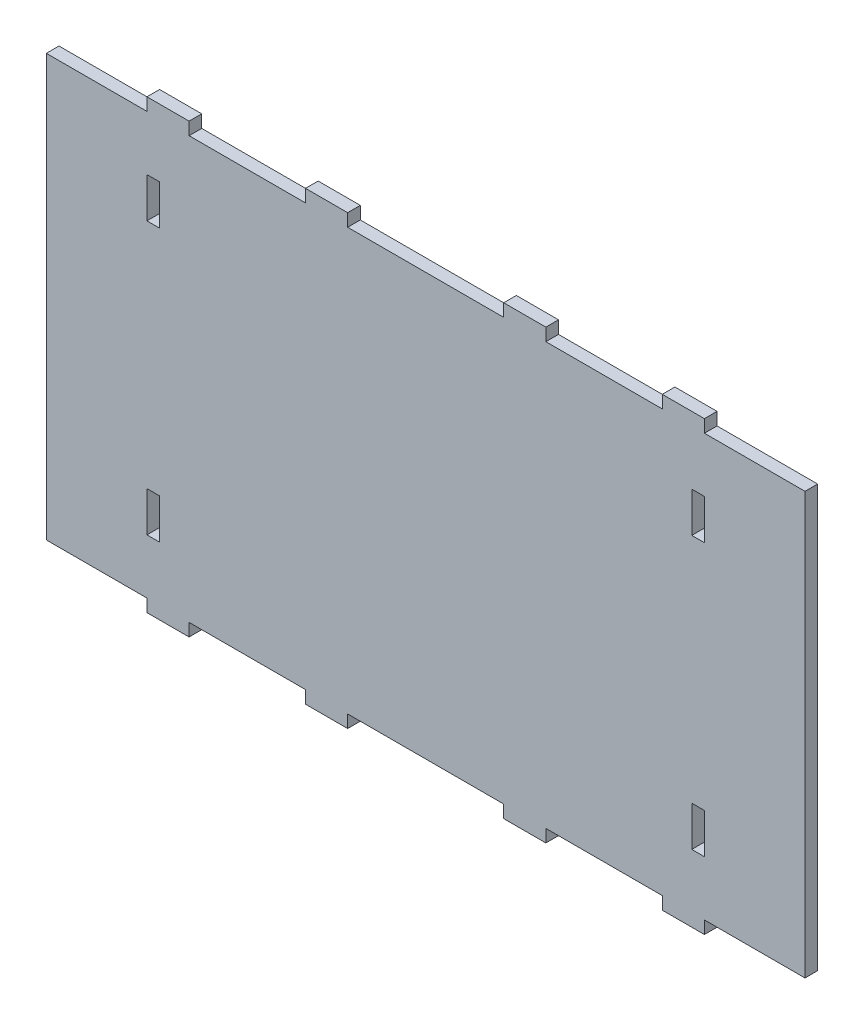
ISO-10303-21;
HEADER;
FILE_DESCRIPTION(('STEP AP214'),'2;1');
FILE_NAME('part.step','',(''),(''),'','','');
FILE_SCHEMA(('AUTOMOTIVE_DESIGN { 1 0 10303 214 1 1 1 1 }'));
ENDSEC;
DATA;
#1=APPLICATION_CONTEXT('core data for automotive mechanical design processes');
#2=APPLICATION_PROTOCOL_DEFINITION('international standard','automotive_design',2000,#1);
#3=PRODUCT_CONTEXT('',#1,'mechanical');
#4=PRODUCT('Part','Part','',(#3));
#5=PRODUCT_RELATED_PRODUCT_CATEGORY('part','',(#4));
#6=PRODUCT_DEFINITION_FORMATION('','',#4);
#7=PRODUCT_DEFINITION_CONTEXT('part definition',#1,'design');
#8=PRODUCT_DEFINITION('design','',#6,#7);
#9=PRODUCT_DEFINITION_SHAPE('','',#8);
#10=(LENGTH_UNIT() NAMED_UNIT(*) SI_UNIT(.MILLI.,.METRE.));
#11=(NAMED_UNIT(*) PLANE_ANGLE_UNIT() SI_UNIT($,.RADIAN.));
#12=(NAMED_UNIT(*) SI_UNIT($,.STERADIAN.) SOLID_ANGLE_UNIT());
#13=UNCERTAINTY_MEASURE_WITH_UNIT(LENGTH_MEASURE(1.E-05),#10,'distance_accuracy_value','');
#14=(GEOMETRIC_REPRESENTATION_CONTEXT(3) GLOBAL_UNCERTAINTY_ASSIGNED_CONTEXT((#13)) GLOBAL_UNIT_ASSIGNED_CONTEXT((#10,
#11,#12)) REPRESENTATION_CONTEXT('',''));
#15=CARTESIAN_POINT('',(0.,0.,0.));
#16=DIRECTION('',(0.,0.,1.));
#17=DIRECTION('',(1.,0.,0.));
#18=AXIS2_PLACEMENT_3D('',#15,#16,#17);
#19=CARTESIAN_POINT('',(-90.,0.,3.));
#20=DIRECTION('',(1.,0.,0.));
#21=DIRECTION('',(0.,0.,-1.));
#22=AXIS2_PLACEMENT_3D('',#19,#20,#21);
#23=PLANE('',#22);
#24=DIRECTION('',(0.,-1.,0.));
#25=VECTOR('',#24,1.);
#26=CARTESIAN_POINT('',(-90.,0.,0.));
#27=LINE('',#26,#25);
#28=CARTESIAN_POINT('',(-90.,100.,0.));
#29=VERTEX_POINT('',#28);
#30=CARTESIAN_POINT('',(-90.,0.,0.));
#31=VERTEX_POINT('',#30);
#32=EDGE_CURVE('E487',#29,#31,#27,.T.);
#33=ORIENTED_EDGE('',*,*,#32,.T.);
#34=DIRECTION('',(0.,0.,-1.));
#35=VECTOR('',#34,1.);
#36=CARTESIAN_POINT('',(-90.,0.,3.));
#37=LINE('',#36,#35);
#38=CARTESIAN_POINT('',(-90.,0.,3.));
#39=VERTEX_POINT('',#38);
#40=EDGE_CURVE('E11',#39,#31,#37,.T.);
#41=ORIENTED_EDGE('',*,*,#40,.F.);
#42=DIRECTION('',(0.,-1.,0.));
#43=VECTOR('',#42,1.);
#44=CARTESIAN_POINT('',(-90.,0.,3.));
#45=LINE('',#44,#43);
#46=CARTESIAN_POINT('',(-90.,100.,3.));
#47=VERTEX_POINT('',#46);
#48=EDGE_CURVE('E494',#47,#39,#45,.T.);
#49=ORIENTED_EDGE('',*,*,#48,.F.);
#50=DIRECTION('',(0.,0.,-1.));
#51=VECTOR('',#50,1.);
#52=CARTESIAN_POINT('',(-90.,100.,3.));
#53=LINE('',#52,#51);
#54=EDGE_CURVE('E568',#47,#29,#53,.T.);
#55=ORIENTED_EDGE('',*,*,#54,.T.);
#56=EDGE_LOOP('',(#33,#41,#49,#55));
#57=FACE_BOUND('',#56,.T.);
#58=ADVANCED_FACE('F33',(#57),#23,.F.);
#59=CARTESIAN_POINT('',(-90.,0.,3.));
#60=DIRECTION('',(0.,1.,0.));
#61=DIRECTION('',(0.,0.,1.));
#62=AXIS2_PLACEMENT_3D('',#59,#60,#61);
#63=PLANE('',#62);
#64=DIRECTION('',(1.,0.,0.));
#65=VECTOR('',#64,1.);
#66=CARTESIAN_POINT('',(-90.,0.,0.));
#67=LINE('',#66,#65);
#68=CARTESIAN_POINT('',(-66.1305116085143,0.,0.));
#69=VERTEX_POINT('',#68);
#70=EDGE_CURVE('E571',#31,#69,#67,.T.);
#71=ORIENTED_EDGE('',*,*,#70,.T.);
#72=DIRECTION('',(0.,0.,-1.));
#73=VECTOR('',#72,1.);
#74=CARTESIAN_POINT('',(-66.1305116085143,0.,3.));
#75=LINE('',#74,#73);
#76=CARTESIAN_POINT('',(-66.1305116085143,0.,3.));
#77=VERTEX_POINT('',#76);
#78=EDGE_CURVE('E40',#77,#69,#75,.T.);
#79=ORIENTED_EDGE('',*,*,#78,.F.);
#80=DIRECTION('',(1.,0.,0.));
#81=VECTOR('',#80,1.);
#82=CARTESIAN_POINT('',(-90.,0.,3.));
#83=LINE('',#82,#81);
#84=EDGE_CURVE('E497',#39,#77,#83,.T.);
#85=ORIENTED_EDGE('',*,*,#84,.F.);
#86=ORIENTED_EDGE('',*,*,#40,.T.);
#87=EDGE_LOOP('',(#71,#79,#85,#86));
#88=FACE_BOUND('',#87,.T.);
#89=ADVANCED_FACE('F767',(#88),#63,.F.);
#90=CARTESIAN_POINT('',(-66.1305116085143,0.,3.));
#91=DIRECTION('',(1.,0.,0.));
#92=DIRECTION('',(0.,0.,-1.));
#93=AXIS2_PLACEMENT_3D('',#90,#91,#92);
#94=PLANE('',#93);
#95=DIRECTION('',(0.,-1.,0.));
#96=VECTOR('',#95,1.);
#97=CARTESIAN_POINT('',(-66.1305116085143,0.,0.));
#98=LINE('',#97,#96);
#99=CARTESIAN_POINT('',(-66.1305116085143,-3.,0.));
#100=VERTEX_POINT('',#99);
#101=EDGE_CURVE('E573',#69,#100,#98,.T.);
#102=ORIENTED_EDGE('',*,*,#101,.T.);
#103=DIRECTION('',(0.,0.,-1.));
#104=VECTOR('',#103,1.);
#105=CARTESIAN_POINT('',(-66.1305116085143,-3.,3.));
#106=LINE('',#105,#104);
#107=CARTESIAN_POINT('',(-66.1305116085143,-3.,3.));
#108=VERTEX_POINT('',#107);
#109=EDGE_CURVE('E738',#108,#100,#106,.T.);
#110=ORIENTED_EDGE('',*,*,#109,.F.);
#111=DIRECTION('',(0.,-1.,0.));
#112=VECTOR('',#111,1.);
#113=CARTESIAN_POINT('',(-66.1305116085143,0.,3.));
#114=LINE('',#113,#112);
#115=EDGE_CURVE('E500',#77,#108,#114,.T.);
#116=ORIENTED_EDGE('',*,*,#115,.F.);
#117=ORIENTED_EDGE('',*,*,#78,.T.);
#118=EDGE_LOOP('',(#102,#110,#116,#117));
#119=FACE_BOUND('',#118,.T.);
#120=ADVANCED_FACE('F745',(#119),#94,.F.);
#121=CARTESIAN_POINT('',(-66.1305116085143,-3.,3.));
#122=DIRECTION('',(0.,1.,0.));
#123=DIRECTION('',(0.,0.,1.));
#124=AXIS2_PLACEMENT_3D('',#121,#122,#123);
#125=PLANE('',#124);
#126=DIRECTION('',(1.,0.,0.));
#127=VECTOR('',#126,1.);
#128=CARTESIAN_POINT('',(-66.1305116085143,-3.,0.));
#129=LINE('',#128,#127);
#130=CARTESIAN_POINT('',(-56.1305116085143,-3.,0.));
#131=VERTEX_POINT('',#130);
#132=EDGE_CURVE('E575',#100,#131,#129,.T.);
#133=ORIENTED_EDGE('',*,*,#132,.T.);
#134=DIRECTION('',(0.,0.,-1.));
#135=VECTOR('',#134,1.);
#136=CARTESIAN_POINT('',(-56.1305116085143,-3.,3.));
#137=LINE('',#136,#135);
#138=CARTESIAN_POINT('',(-56.1305116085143,-3.,3.));
#139=VERTEX_POINT('',#138);
#140=EDGE_CURVE('E735',#139,#131,#137,.T.);
#141=ORIENTED_EDGE('',*,*,#140,.F.);
#142=DIRECTION('',(1.,0.,0.));
#143=VECTOR('',#142,1.);
#144=CARTESIAN_POINT('',(-66.1305116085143,-3.,3.));
#145=LINE('',#144,#143);
#146=EDGE_CURVE('E502',#108,#139,#145,.T.);
#147=ORIENTED_EDGE('',*,*,#146,.F.);
#148=ORIENTED_EDGE('',*,*,#109,.T.);
#149=EDGE_LOOP('',(#133,#141,#147,#148));
#150=FACE_BOUND('',#149,.T.);
#151=ADVANCED_FACE('F755',(#150),#125,.F.);
#152=CARTESIAN_POINT('',(-56.1305116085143,-3.,3.));
#153=DIRECTION('',(-1.,0.,0.));
#154=DIRECTION('',(0.,0.,1.));
#155=AXIS2_PLACEMENT_3D('',#152,#153,#154);
#156=PLANE('',#155);
#157=DIRECTION('',(0.,1.,0.));
#158=VECTOR('',#157,1.);
#159=CARTESIAN_POINT('',(-56.1305116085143,-3.,0.));
#160=LINE('',#159,#158);
#161=CARTESIAN_POINT('',(-56.1305116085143,0.,0.));
#162=VERTEX_POINT('',#161);
#163=EDGE_CURVE('E577',#131,#162,#160,.T.);
#164=ORIENTED_EDGE('',*,*,#163,.T.);
#165=DIRECTION('',(0.,0.,-1.));
#166=VECTOR('',#165,1.);
#167=CARTESIAN_POINT('',(-56.1305116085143,0.,3.));
#168=LINE('',#167,#166);
#169=CARTESIAN_POINT('',(-56.1305116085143,0.,3.));
#170=VERTEX_POINT('',#169);
#171=EDGE_CURVE('E732',#170,#162,#168,.T.);
#172=ORIENTED_EDGE('',*,*,#171,.F.);
#173=DIRECTION('',(0.,1.,0.));
#174=VECTOR('',#173,1.);
#175=CARTESIAN_POINT('',(-56.1305116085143,-3.,3.));
#176=LINE('',#175,#174);
#177=EDGE_CURVE('E504',#139,#170,#176,.T.);
#178=ORIENTED_EDGE('',*,*,#177,.F.);
#179=ORIENTED_EDGE('',*,*,#140,.T.);
#180=EDGE_LOOP('',(#164,#172,#178,#179));
#181=FACE_BOUND('',#180,.T.);
#182=ADVANCED_FACE('F759',(#181),#156,.F.);
#183=CARTESIAN_POINT('',(-56.1305116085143,0.,3.));
#184=DIRECTION('',(0.,1.,0.));
#185=DIRECTION('',(0.,0.,1.));
#186=AXIS2_PLACEMENT_3D('',#183,#184,#185);
#187=PLANE('',#186);
#188=DIRECTION('',(1.,0.,0.));
#189=VECTOR('',#188,1.);
#190=CARTESIAN_POINT('',(-56.1305116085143,0.,0.));
#191=LINE('',#190,#189);
#192=CARTESIAN_POINT('',(-28.5111518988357,0.,0.));
#193=VERTEX_POINT('',#192);
#194=EDGE_CURVE('E579',#162,#193,#191,.T.);
#195=ORIENTED_EDGE('',*,*,#194,.T.);
#196=DIRECTION('',(0.,0.,-1.));
#197=VECTOR('',#196,1.);
#198=CARTESIAN_POINT('',(-28.5111518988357,0.,3.));
#199=LINE('',#198,#197);
#200=CARTESIAN_POINT('',(-28.5111518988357,0.,3.));
#201=VERTEX_POINT('',#200);
#202=EDGE_CURVE('E729',#201,#193,#199,.T.);
#203=ORIENTED_EDGE('',*,*,#202,.F.);
#204=DIRECTION('',(1.,0.,0.));
#205=VECTOR('',#204,1.);
#206=CARTESIAN_POINT('',(-56.1305116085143,0.,3.));
#207=LINE('',#206,#205);
#208=EDGE_CURVE('E506',#170,#201,#207,.T.);
#209=ORIENTED_EDGE('',*,*,#208,.F.);
#210=ORIENTED_EDGE('',*,*,#171,.T.);
#211=EDGE_LOOP('',(#195,#203,#209,#210));
#212=FACE_BOUND('',#211,.T.);
#213=ADVANCED_FACE('F920',(#212),#187,.F.);
#214=CARTESIAN_POINT('',(-28.5111518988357,0.,3.));
#215=DIRECTION('',(1.,0.,0.));
#216=DIRECTION('',(0.,0.,-1.));
#217=AXIS2_PLACEMENT_3D('',#214,#215,#216);
#218=PLANE('',#217);
#219=DIRECTION('',(0.,-1.,0.));
#220=VECTOR('',#219,1.);
#221=CARTESIAN_POINT('',(-28.5111518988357,0.,0.));
#222=LINE('',#221,#220);
#223=CARTESIAN_POINT('',(-28.5111518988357,-3.,0.));
#224=VERTEX_POINT('',#223);
#225=EDGE_CURVE('E581',#193,#224,#222,.T.);
#226=ORIENTED_EDGE('',*,*,#225,.T.);
#227=DIRECTION('',(0.,0.,-1.));
#228=VECTOR('',#227,1.);
#229=CARTESIAN_POINT('',(-28.5111518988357,-3.,3.));
#230=LINE('',#229,#228);
#231=CARTESIAN_POINT('',(-28.5111518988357,-3.,3.));
#232=VERTEX_POINT('',#231);
#233=EDGE_CURVE('E726',#232,#224,#230,.T.);
#234=ORIENTED_EDGE('',*,*,#233,.F.);
#235=DIRECTION('',(0.,-1.,0.));
#236=VECTOR('',#235,1.);
#237=CARTESIAN_POINT('',(-28.5111518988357,0.,3.));
#238=LINE('',#237,#236);
#239=EDGE_CURVE('E508',#201,#232,#238,.T.);
#240=ORIENTED_EDGE('',*,*,#239,.F.);
#241=ORIENTED_EDGE('',*,*,#202,.T.);
#242=EDGE_LOOP('',(#226,#234,#240,#241));
#243=FACE_BOUND('',#242,.T.);
#244=ADVANCED_FACE('F918',(#243),#218,.F.);
#245=CARTESIAN_POINT('',(-28.5111518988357,-3.,3.));
#246=DIRECTION('',(0.,1.,0.));
#247=DIRECTION('',(0.,0.,1.));
#248=AXIS2_PLACEMENT_3D('',#245,#246,#247);
#249=PLANE('',#248);
#250=DIRECTION('',(1.,0.,0.));
#251=VECTOR('',#250,1.);
#252=CARTESIAN_POINT('',(-28.5111518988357,-3.,0.));
#253=LINE('',#252,#251);
#254=CARTESIAN_POINT('',(-18.5111518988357,-3.,0.));
#255=VERTEX_POINT('',#254);
#256=EDGE_CURVE('E583',#224,#255,#253,.T.);
#257=ORIENTED_EDGE('',*,*,#256,.T.);
#258=DIRECTION('',(0.,0.,-1.));
#259=VECTOR('',#258,1.);
#260=CARTESIAN_POINT('',(-18.5111518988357,-3.,3.));
#261=LINE('',#260,#259);
#262=CARTESIAN_POINT('',(-18.5111518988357,-3.,3.));
#263=VERTEX_POINT('',#262);
#264=EDGE_CURVE('E723',#263,#255,#261,.T.);
#265=ORIENTED_EDGE('',*,*,#264,.F.);
#266=DIRECTION('',(1.,0.,0.));
#267=VECTOR('',#266,1.);
#268=CARTESIAN_POINT('',(-28.5111518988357,-3.,3.));
#269=LINE('',#268,#267);
#270=EDGE_CURVE('E510',#232,#263,#269,.T.);
#271=ORIENTED_EDGE('',*,*,#270,.F.);
#272=ORIENTED_EDGE('',*,*,#233,.T.);
#273=EDGE_LOOP('',(#257,#265,#271,#272));
#274=FACE_BOUND('',#273,.T.);
#275=ADVANCED_FACE('F914',(#274),#249,.F.);
#276=CARTESIAN_POINT('',(-18.5111518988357,-3.,3.));
#277=DIRECTION('',(-1.,0.,0.));
#278=DIRECTION('',(0.,0.,1.));
#279=AXIS2_PLACEMENT_3D('',#276,#277,#278);
#280=PLANE('',#279);
#281=DIRECTION('',(0.,1.,0.));
#282=VECTOR('',#281,1.);
#283=CARTESIAN_POINT('',(-18.5111518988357,-3.,0.));
#284=LINE('',#283,#282);
#285=CARTESIAN_POINT('',(-18.5111518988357,0.,0.));
#286=VERTEX_POINT('',#285);
#287=EDGE_CURVE('E585',#255,#286,#284,.T.);
#288=ORIENTED_EDGE('',*,*,#287,.T.);
#289=DIRECTION('',(0.,0.,-1.));
#290=VECTOR('',#289,1.);
#291=CARTESIAN_POINT('',(-18.5111518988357,0.,3.));
#292=LINE('',#291,#290);
#293=CARTESIAN_POINT('',(-18.5111518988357,0.,3.));
#294=VERTEX_POINT('',#293);
#295=EDGE_CURVE('E720',#294,#286,#292,.T.);
#296=ORIENTED_EDGE('',*,*,#295,.F.);
#297=DIRECTION('',(0.,1.,0.));
#298=VECTOR('',#297,1.);
#299=CARTESIAN_POINT('',(-18.5111518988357,-3.,3.));
#300=LINE('',#299,#298);
#301=EDGE_CURVE('E512',#263,#294,#300,.T.);
#302=ORIENTED_EDGE('',*,*,#301,.F.);
#303=ORIENTED_EDGE('',*,*,#264,.T.);
#304=EDGE_LOOP('',(#288,#296,#302,#303));
#305=FACE_BOUND('',#304,.T.);
#306=ADVANCED_FACE('F909',(#305),#280,.F.);
#307=CARTESIAN_POINT('',(-18.5111518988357,0.,3.));
#308=DIRECTION('',(0.,1.,0.));
#309=DIRECTION('',(0.,0.,1.));
#310=AXIS2_PLACEMENT_3D('',#307,#308,#309);
#311=PLANE('',#310);
#312=DIRECTION('',(1.,0.,0.));
#313=VECTOR('',#312,1.);
#314=CARTESIAN_POINT('',(-18.5111518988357,0.,0.));
#315=LINE('',#314,#313);
#316=CARTESIAN_POINT('',(18.5111518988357,0.,0.));
#317=VERTEX_POINT('',#316);
#318=EDGE_CURVE('E587',#286,#317,#315,.T.);
#319=ORIENTED_EDGE('',*,*,#318,.T.);
#320=DIRECTION('',(0.,0.,-1.));
#321=VECTOR('',#320,1.);
#322=CARTESIAN_POINT('',(18.5111518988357,0.,3.));
#323=LINE('',#322,#321);
#324=CARTESIAN_POINT('',(18.5111518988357,0.,3.));
#325=VERTEX_POINT('',#324);
#326=EDGE_CURVE('E717',#325,#317,#323,.T.);
#327=ORIENTED_EDGE('',*,*,#326,.F.);
#328=DIRECTION('',(1.,0.,0.));
#329=VECTOR('',#328,1.);
#330=CARTESIAN_POINT('',(-18.5111518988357,0.,3.));
#331=LINE('',#330,#329);
#332=EDGE_CURVE('E514',#294,#325,#331,.T.);
#333=ORIENTED_EDGE('',*,*,#332,.F.);
#334=ORIENTED_EDGE('',*,*,#295,.T.);
#335=EDGE_LOOP('',(#319,#327,#333,#334));
#336=FACE_BOUND('',#335,.T.);
#337=ADVANCED_FACE('F903',(#336),#311,.F.);
#338=CARTESIAN_POINT('',(18.5111518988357,-3.,3.));
#339=DIRECTION('',(1.,0.,0.));
#340=DIRECTION('',(0.,0.,-1.));
#341=AXIS2_PLACEMENT_3D('',#338,#339,#340);
#342=PLANE('',#341);
#343=DIRECTION('',(0.,-1.,0.));
#344=VECTOR('',#343,1.);
#345=CARTESIAN_POINT('',(18.5111518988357,-3.,0.));
#346=LINE('',#345,#344);
#347=CARTESIAN_POINT('',(18.5111518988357,-3.,0.));
#348=VERTEX_POINT('',#347);
#349=EDGE_CURVE('E589',#317,#348,#346,.T.);
#350=ORIENTED_EDGE('',*,*,#349,.T.);
#351=DIRECTION('',(0.,0.,-1.));
#352=VECTOR('',#351,1.);
#353=CARTESIAN_POINT('',(18.5111518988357,-3.,3.));
#354=LINE('',#353,#352);
#355=CARTESIAN_POINT('',(18.5111518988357,-3.,3.));
#356=VERTEX_POINT('',#355);
#357=EDGE_CURVE('E714',#356,#348,#354,.T.);
#358=ORIENTED_EDGE('',*,*,#357,.F.);
#359=DIRECTION('',(0.,-1.,0.));
#360=VECTOR('',#359,1.);
#361=CARTESIAN_POINT('',(18.5111518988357,-3.,3.));
#362=LINE('',#361,#360);
#363=EDGE_CURVE('E516',#325,#356,#362,.T.);
#364=ORIENTED_EDGE('',*,*,#363,.F.);
#365=ORIENTED_EDGE('',*,*,#326,.T.);
#366=EDGE_LOOP('',(#350,#358,#364,#365));
#367=FACE_BOUND('',#366,.T.);
#368=ADVANCED_FACE('F899',(#367),#342,.F.);
#369=CARTESIAN_POINT('',(28.5111518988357,-3.,3.));
#370=DIRECTION('',(0.,1.,0.));
#371=DIRECTION('',(0.,0.,1.));
#372=AXIS2_PLACEMENT_3D('',#369,#370,#371);
#373=PLANE('',#372);
#374=DIRECTION('',(1.,0.,0.));
#375=VECTOR('',#374,1.);
#376=CARTESIAN_POINT('',(28.5111518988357,-3.,0.));
#377=LINE('',#376,#375);
#378=CARTESIAN_POINT('',(28.5111518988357,-3.,0.));
#379=VERTEX_POINT('',#378);
#380=EDGE_CURVE('E591',#348,#379,#377,.T.);
#381=ORIENTED_EDGE('',*,*,#380,.T.);
#382=DIRECTION('',(0.,0.,-1.));
#383=VECTOR('',#382,1.);
#384=CARTESIAN_POINT('',(28.5111518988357,-3.,3.));
#385=LINE('',#384,#383);
#386=CARTESIAN_POINT('',(28.5111518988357,-3.,3.));
#387=VERTEX_POINT('',#386);
#388=EDGE_CURVE('E711',#387,#379,#385,.T.);
#389=ORIENTED_EDGE('',*,*,#388,.F.);
#390=DIRECTION('',(1.,0.,0.));
#391=VECTOR('',#390,1.);
#392=CARTESIAN_POINT('',(28.5111518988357,-3.,3.));
#393=LINE('',#392,#391);
#394=EDGE_CURVE('E518',#356,#387,#393,.T.);
#395=ORIENTED_EDGE('',*,*,#394,.F.);
#396=ORIENTED_EDGE('',*,*,#357,.T.);
#397=EDGE_LOOP('',(#381,#389,#395,#396));
#398=FACE_BOUND('',#397,.T.);
#399=ADVANCED_FACE('F894',(#398),#373,.F.);
#400=CARTESIAN_POINT('',(28.5111518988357,0.,3.));
#401=DIRECTION('',(-1.,0.,0.));
#402=DIRECTION('',(0.,0.,1.));
#403=AXIS2_PLACEMENT_3D('',#400,#401,#402);
#404=PLANE('',#403);
#405=DIRECTION('',(0.,1.,0.));
#406=VECTOR('',#405,1.);
#407=CARTESIAN_POINT('',(28.5111518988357,0.,0.));
#408=LINE('',#407,#406);
#409=CARTESIAN_POINT('',(28.5111518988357,0.,0.));
#410=VERTEX_POINT('',#409);
#411=EDGE_CURVE('E593',#379,#410,#408,.T.);
#412=ORIENTED_EDGE('',*,*,#411,.T.);
#413=DIRECTION('',(0.,0.,-1.));
#414=VECTOR('',#413,1.);
#415=CARTESIAN_POINT('',(28.5111518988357,0.,3.));
#416=LINE('',#415,#414);
#417=CARTESIAN_POINT('',(28.5111518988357,0.,3.));
#418=VERTEX_POINT('',#417);
#419=EDGE_CURVE('E708',#418,#410,#416,.T.);
#420=ORIENTED_EDGE('',*,*,#419,.F.);
#421=DIRECTION('',(0.,1.,0.));
#422=VECTOR('',#421,1.);
#423=CARTESIAN_POINT('',(28.5111518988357,0.,3.));
#424=LINE('',#423,#422);
#425=EDGE_CURVE('E520',#387,#418,#424,.T.);
#426=ORIENTED_EDGE('',*,*,#425,.F.);
#427=ORIENTED_EDGE('',*,*,#388,.T.);
#428=EDGE_LOOP('',(#412,#420,#426,#427));
#429=FACE_BOUND('',#428,.T.);
#430=ADVANCED_FACE('F888',(#429),#404,.F.);
#431=CARTESIAN_POINT('',(56.1305116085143,0.,3.));
#432=DIRECTION('',(0.,1.,0.));
#433=DIRECTION('',(0.,0.,1.));
#434=AXIS2_PLACEMENT_3D('',#431,#432,#433);
#435=PLANE('',#434);
#436=DIRECTION('',(1.,0.,0.));
#437=VECTOR('',#436,1.);
#438=CARTESIAN_POINT('',(56.1305116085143,0.,0.));
#439=LINE('',#438,#437);
#440=CARTESIAN_POINT('',(56.1305116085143,0.,0.));
#441=VERTEX_POINT('',#440);
#442=EDGE_CURVE('E595',#410,#441,#439,.T.);
#443=ORIENTED_EDGE('',*,*,#442,.T.);
#444=DIRECTION('',(0.,0.,-1.));
#445=VECTOR('',#444,1.);
#446=CARTESIAN_POINT('',(56.1305116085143,0.,3.));
#447=LINE('',#446,#445);
#448=CARTESIAN_POINT('',(56.1305116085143,0.,3.));
#449=VERTEX_POINT('',#448);
#450=EDGE_CURVE('E705',#449,#441,#447,.T.);
#451=ORIENTED_EDGE('',*,*,#450,.F.);
#452=DIRECTION('',(1.,0.,0.));
#453=VECTOR('',#452,1.);
#454=CARTESIAN_POINT('',(56.1305116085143,0.,3.));
#455=LINE('',#454,#453);
#456=EDGE_CURVE('E522',#418,#449,#455,.T.);
#457=ORIENTED_EDGE('',*,*,#456,.F.);
#458=ORIENTED_EDGE('',*,*,#419,.T.);
#459=EDGE_LOOP('',(#443,#451,#457,#458));
#460=FACE_BOUND('',#459,.T.);
#461=ADVANCED_FACE('F884',(#460),#435,.F.);
#462=CARTESIAN_POINT('',(56.1305116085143,-3.,3.));
#463=DIRECTION('',(1.,0.,0.));
#464=DIRECTION('',(0.,0.,-1.));
#465=AXIS2_PLACEMENT_3D('',#462,#463,#464);
#466=PLANE('',#465);
#467=DIRECTION('',(0.,-1.,0.));
#468=VECTOR('',#467,1.);
#469=CARTESIAN_POINT('',(56.1305116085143,-3.,0.));
#470=LINE('',#469,#468);
#471=CARTESIAN_POINT('',(56.1305116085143,-3.,0.));
#472=VERTEX_POINT('',#471);
#473=EDGE_CURVE('E597',#441,#472,#470,.T.);
#474=ORIENTED_EDGE('',*,*,#473,.T.);
#475=DIRECTION('',(0.,0.,-1.));
#476=VECTOR('',#475,1.);
#477=CARTESIAN_POINT('',(56.1305116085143,-3.,3.));
#478=LINE('',#477,#476);
#479=CARTESIAN_POINT('',(56.1305116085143,-3.,3.));
#480=VERTEX_POINT('',#479);
#481=EDGE_CURVE('E702',#480,#472,#478,.T.);
#482=ORIENTED_EDGE('',*,*,#481,.F.);
#483=DIRECTION('',(0.,-1.,0.));
#484=VECTOR('',#483,1.);
#485=CARTESIAN_POINT('',(56.1305116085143,-3.,3.));
#486=LINE('',#485,#484);
#487=EDGE_CURVE('E524',#449,#480,#486,.T.);
#488=ORIENTED_EDGE('',*,*,#487,.F.);
#489=ORIENTED_EDGE('',*,*,#450,.T.);
#490=EDGE_LOOP('',(#474,#482,#488,#489));
#491=FACE_BOUND('',#490,.T.);
#492=ADVANCED_FACE('F879',(#491),#466,.F.);
#493=CARTESIAN_POINT('',(66.1305116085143,-3.,3.));
#494=DIRECTION('',(0.,1.,0.));
#495=DIRECTION('',(0.,0.,1.));
#496=AXIS2_PLACEMENT_3D('',#493,#494,#495);
#497=PLANE('',#496);
#498=DIRECTION('',(1.,0.,0.));
#499=VECTOR('',#498,1.);
#500=CARTESIAN_POINT('',(66.1305116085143,-3.,0.));
#501=LINE('',#500,#499);
#502=CARTESIAN_POINT('',(66.1305116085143,-3.,0.));
#503=VERTEX_POINT('',#502);
#504=EDGE_CURVE('E599',#472,#503,#501,.T.);
#505=ORIENTED_EDGE('',*,*,#504,.T.);
#506=DIRECTION('',(0.,0.,-1.));
#507=VECTOR('',#506,1.);
#508=CARTESIAN_POINT('',(66.1305116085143,-3.,3.));
#509=LINE('',#508,#507);
#510=CARTESIAN_POINT('',(66.1305116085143,-3.,3.));
#511=VERTEX_POINT('',#510);
#512=EDGE_CURVE('E699',#511,#503,#509,.T.);
#513=ORIENTED_EDGE('',*,*,#512,.F.);
#514=DIRECTION('',(1.,0.,0.));
#515=VECTOR('',#514,1.);
#516=CARTESIAN_POINT('',(66.1305116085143,-3.,3.));
#517=LINE('',#516,#515);
#518=EDGE_CURVE('E526',#480,#511,#517,.T.);
#519=ORIENTED_EDGE('',*,*,#518,.F.);
#520=ORIENTED_EDGE('',*,*,#481,.T.);
#521=EDGE_LOOP('',(#505,#513,#519,#520));
#522=FACE_BOUND('',#521,.T.);
#523=ADVANCED_FACE('F873',(#522),#497,.F.);
#524=CARTESIAN_POINT('',(66.1305116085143,0.,3.));
#525=DIRECTION('',(-1.,0.,0.));
#526=DIRECTION('',(0.,0.,1.));
#527=AXIS2_PLACEMENT_3D('',#524,#525,#526);
#528=PLANE('',#527);
#529=DIRECTION('',(0.,1.,0.));
#530=VECTOR('',#529,1.);
#531=CARTESIAN_POINT('',(66.1305116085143,0.,0.));
#532=LINE('',#531,#530);
#533=CARTESIAN_POINT('',(66.1305116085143,0.,0.));
#534=VERTEX_POINT('',#533);
#535=EDGE_CURVE('E601',#503,#534,#532,.T.);
#536=ORIENTED_EDGE('',*,*,#535,.T.);
#537=DIRECTION('',(0.,0.,-1.));
#538=VECTOR('',#537,1.);
#539=CARTESIAN_POINT('',(66.1305116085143,0.,3.));
#540=LINE('',#539,#538);
#541=CARTESIAN_POINT('',(66.1305116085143,0.,3.));
#542=VERTEX_POINT('',#541);
#543=EDGE_CURVE('E696',#542,#534,#540,.T.);
#544=ORIENTED_EDGE('',*,*,#543,.F.);
#545=DIRECTION('',(0.,1.,0.));
#546=VECTOR('',#545,1.);
#547=CARTESIAN_POINT('',(66.1305116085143,0.,3.));
#548=LINE('',#547,#546);
#549=EDGE_CURVE('E528',#511,#542,#548,.T.);
#550=ORIENTED_EDGE('',*,*,#549,.F.);
#551=ORIENTED_EDGE('',*,*,#512,.T.);
#552=EDGE_LOOP('',(#536,#544,#550,#551));
#553=FACE_BOUND('',#552,.T.);
#554=ADVANCED_FACE('F869',(#553),#528,.F.);
#555=CARTESIAN_POINT('',(90.,0.,3.));
#556=DIRECTION('',(0.,1.,0.));
#557=DIRECTION('',(-1.,0.,0.));
#558=AXIS2_PLACEMENT_3D('',#555,#556,#557);
#559=PLANE('',#558);
#560=DIRECTION('',(1.,0.,0.));
#561=VECTOR('',#560,1.);
#562=CARTESIAN_POINT('',(90.,0.,0.));
#563=LINE('',#562,#561);
#564=CARTESIAN_POINT('',(90.,0.,0.));
#565=VERTEX_POINT('',#564);
#566=EDGE_CURVE('E603',#534,#565,#563,.T.);
#567=ORIENTED_EDGE('',*,*,#566,.T.);
#568=DIRECTION('',(0.,0.,-1.));
#569=VECTOR('',#568,1.);
#570=CARTESIAN_POINT('',(90.,0.,3.));
#571=LINE('',#570,#569);
#572=CARTESIAN_POINT('',(90.,0.,3.));
#573=VERTEX_POINT('',#572);
#574=EDGE_CURVE('E693',#573,#565,#571,.T.);
#575=ORIENTED_EDGE('',*,*,#574,.F.);
#576=DIRECTION('',(1.,0.,0.));
#577=VECTOR('',#576,1.);
#578=CARTESIAN_POINT('',(90.,0.,3.));
#579=LINE('',#578,#577);
#580=EDGE_CURVE('E530',#542,#573,#579,.T.);
#581=ORIENTED_EDGE('',*,*,#580,.F.);
#582=ORIENTED_EDGE('',*,*,#543,.T.);
#583=EDGE_LOOP('',(#567,#575,#581,#582));
#584=FACE_BOUND('',#583,.T.);
#585=ADVANCED_FACE('F864',(#584),#559,.F.);
#586=CARTESIAN_POINT('',(90.,100.,3.));
#587=DIRECTION('',(-1.,0.,0.));
#588=DIRECTION('',(0.,-1.,0.));
#589=AXIS2_PLACEMENT_3D('',#586,#587,#588);
#590=PLANE('',#589);
#591=DIRECTION('',(0.,1.,0.));
#592=VECTOR('',#591,1.);
#593=CARTESIAN_POINT('',(90.,100.,0.));
#594=LINE('',#593,#592);
#595=CARTESIAN_POINT('',(90.,100.,0.));
#596=VERTEX_POINT('',#595);
#597=EDGE_CURVE('E605',#565,#596,#594,.T.);
#598=ORIENTED_EDGE('',*,*,#597,.T.);
#599=DIRECTION('',(0.,0.,-1.));
#600=VECTOR('',#599,1.);
#601=CARTESIAN_POINT('',(90.,100.,3.));
#602=LINE('',#601,#600);
#603=CARTESIAN_POINT('',(90.,100.,3.));
#604=VERTEX_POINT('',#603);
#605=EDGE_CURVE('E690',#604,#596,#602,.T.);
#606=ORIENTED_EDGE('',*,*,#605,.F.);
#607=DIRECTION('',(0.,1.,0.));
#608=VECTOR('',#607,1.);
#609=CARTESIAN_POINT('',(90.,100.,3.));
#610=LINE('',#609,#608);
#611=EDGE_CURVE('E532',#573,#604,#610,.T.);
#612=ORIENTED_EDGE('',*,*,#611,.F.);
#613=ORIENTED_EDGE('',*,*,#574,.T.);
#614=EDGE_LOOP('',(#598,#606,#612,#613));
#615=FACE_BOUND('',#614,.T.);
#616=ADVANCED_FACE('F858',(#615),#590,.F.);
#617=CARTESIAN_POINT('',(90.,100.,3.));
#618=DIRECTION('',(0.,-1.,0.));
#619=DIRECTION('',(1.,0.,0.));
#620=AXIS2_PLACEMENT_3D('',#617,#618,#619);
#621=PLANE('',#620);
#622=DIRECTION('',(-1.,0.,0.));
#623=VECTOR('',#622,1.);
#624=CARTESIAN_POINT('',(90.,100.,0.));
#625=LINE('',#624,#623);
#626=CARTESIAN_POINT('',(66.1305116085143,100.,0.));
#627=VERTEX_POINT('',#626);
#628=EDGE_CURVE('E607',#596,#627,#625,.T.);
#629=ORIENTED_EDGE('',*,*,#628,.T.);
#630=DIRECTION('',(0.,0.,-1.));
#631=VECTOR('',#630,1.);
#632=CARTESIAN_POINT('',(66.1305116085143,100.,3.));
#633=LINE('',#632,#631);
#634=CARTESIAN_POINT('',(66.1305116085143,100.,3.));
#635=VERTEX_POINT('',#634);
#636=EDGE_CURVE('E687',#635,#627,#633,.T.);
#637=ORIENTED_EDGE('',*,*,#636,.F.);
#638=DIRECTION('',(-1.,0.,0.));
#639=VECTOR('',#638,1.);
#640=CARTESIAN_POINT('',(90.,100.,3.));
#641=LINE('',#640,#639);
#642=EDGE_CURVE('E534',#604,#635,#641,.T.);
#643=ORIENTED_EDGE('',*,*,#642,.F.);
#644=ORIENTED_EDGE('',*,*,#605,.T.);
#645=EDGE_LOOP('',(#629,#637,#643,#644));
#646=FACE_BOUND('',#645,.T.);
#647=ADVANCED_FACE('F854',(#646),#621,.F.);
#648=CARTESIAN_POINT('',(66.1305116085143,100.,3.));
#649=DIRECTION('',(-1.,0.,0.));
#650=DIRECTION('',(0.,0.,1.));
#651=AXIS2_PLACEMENT_3D('',#648,#649,#650);
#652=PLANE('',#651);
#653=DIRECTION('',(0.,1.,0.));
#654=VECTOR('',#653,1.);
#655=CARTESIAN_POINT('',(66.1305116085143,100.,0.));
#656=LINE('',#655,#654);
#657=CARTESIAN_POINT('',(66.1305116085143,103.,0.));
#658=VERTEX_POINT('',#657);
#659=EDGE_CURVE('E609',#627,#658,#656,.T.);
#660=ORIENTED_EDGE('',*,*,#659,.T.);
#661=DIRECTION('',(0.,0.,-1.));
#662=VECTOR('',#661,1.);
#663=CARTESIAN_POINT('',(66.1305116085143,103.,3.));
#664=LINE('',#663,#662);
#665=CARTESIAN_POINT('',(66.1305116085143,103.,3.));
#666=VERTEX_POINT('',#665);
#667=EDGE_CURVE('E684',#666,#658,#664,.T.);
#668=ORIENTED_EDGE('',*,*,#667,.F.);
#669=DIRECTION('',(0.,1.,0.));
#670=VECTOR('',#669,1.);
#671=CARTESIAN_POINT('',(66.1305116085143,100.,3.));
#672=LINE('',#671,#670);
#673=EDGE_CURVE('E536',#635,#666,#672,.T.);
#674=ORIENTED_EDGE('',*,*,#673,.F.);
#675=ORIENTED_EDGE('',*,*,#636,.T.);
#676=EDGE_LOOP('',(#660,#668,#674,#675));
#677=FACE_BOUND('',#676,.T.);
#678=ADVANCED_FACE('F849',(#677),#652,.F.);
#679=CARTESIAN_POINT('',(66.1305116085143,103.,3.));
#680=DIRECTION('',(0.,-1.,0.));
#681=DIRECTION('',(1.,0.,0.));
#682=AXIS2_PLACEMENT_3D('',#679,#680,#681);
#683=PLANE('',#682);
#684=DIRECTION('',(-1.,0.,0.));
#685=VECTOR('',#684,1.);
#686=CARTESIAN_POINT('',(66.1305116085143,103.,0.));
#687=LINE('',#686,#685);
#688=CARTESIAN_POINT('',(56.1305116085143,103.,0.));
#689=VERTEX_POINT('',#688);
#690=EDGE_CURVE('E611',#658,#689,#687,.T.);
#691=ORIENTED_EDGE('',*,*,#690,.T.);
#692=DIRECTION('',(0.,0.,-1.));
#693=VECTOR('',#692,1.);
#694=CARTESIAN_POINT('',(56.1305116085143,103.,3.));
#695=LINE('',#694,#693);
#696=CARTESIAN_POINT('',(56.1305116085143,103.,3.));
#697=VERTEX_POINT('',#696);
#698=EDGE_CURVE('E681',#697,#689,#695,.T.);
#699=ORIENTED_EDGE('',*,*,#698,.F.);
#700=DIRECTION('',(-1.,0.,0.));
#701=VECTOR('',#700,1.);
#702=CARTESIAN_POINT('',(66.1305116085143,103.,3.));
#703=LINE('',#702,#701);
#704=EDGE_CURVE('E538',#666,#697,#703,.T.);
#705=ORIENTED_EDGE('',*,*,#704,.F.);
#706=ORIENTED_EDGE('',*,*,#667,.T.);
#707=EDGE_LOOP('',(#691,#699,#705,#706));
#708=FACE_BOUND('',#707,.T.);
#709=ADVANCED_FACE('F843',(#708),#683,.F.);
#710=CARTESIAN_POINT('',(56.1305116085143,103.,3.));
#711=DIRECTION('',(1.,0.,0.));
#712=DIRECTION('',(0.,1.,0.));
#713=AXIS2_PLACEMENT_3D('',#710,#711,#712);
#714=PLANE('',#713);
#715=DIRECTION('',(0.,-1.,0.));
#716=VECTOR('',#715,1.);
#717=CARTESIAN_POINT('',(56.1305116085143,103.,0.));
#718=LINE('',#717,#716);
#719=CARTESIAN_POINT('',(56.1305116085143,100.,0.));
#720=VERTEX_POINT('',#719);
#721=EDGE_CURVE('E613',#689,#720,#718,.T.);
#722=ORIENTED_EDGE('',*,*,#721,.T.);
#723=DIRECTION('',(0.,0.,-1.));
#724=VECTOR('',#723,1.);
#725=CARTESIAN_POINT('',(56.1305116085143,100.,3.));
#726=LINE('',#725,#724);
#727=CARTESIAN_POINT('',(56.1305116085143,100.,3.));
#728=VERTEX_POINT('',#727);
#729=EDGE_CURVE('E678',#728,#720,#726,.T.);
#730=ORIENTED_EDGE('',*,*,#729,.F.);
#731=DIRECTION('',(0.,-1.,0.));
#732=VECTOR('',#731,1.);
#733=CARTESIAN_POINT('',(56.1305116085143,103.,3.));
#734=LINE('',#733,#732);
#735=EDGE_CURVE('E540',#697,#728,#734,.T.);
#736=ORIENTED_EDGE('',*,*,#735,.F.);
#737=ORIENTED_EDGE('',*,*,#698,.T.);
#738=EDGE_LOOP('',(#722,#730,#736,#737));
#739=FACE_BOUND('',#738,.T.);
#740=ADVANCED_FACE('F839',(#739),#714,.F.);
#741=CARTESIAN_POINT('',(56.1305116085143,100.,3.));
#742=DIRECTION('',(0.,-1.,0.));
#743=DIRECTION('',(1.,0.,0.));
#744=AXIS2_PLACEMENT_3D('',#741,#742,#743);
#745=PLANE('',#744);
#746=DIRECTION('',(-1.,0.,0.));
#747=VECTOR('',#746,1.);
#748=CARTESIAN_POINT('',(56.1305116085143,100.,0.));
#749=LINE('',#748,#747);
#750=CARTESIAN_POINT('',(28.5111518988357,100.,0.));
#751=VERTEX_POINT('',#750);
#752=EDGE_CURVE('E615',#720,#751,#749,.T.);
#753=ORIENTED_EDGE('',*,*,#752,.T.);
#754=DIRECTION('',(0.,0.,-1.));
#755=VECTOR('',#754,1.);
#756=CARTESIAN_POINT('',(28.5111518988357,100.,3.));
#757=LINE('',#756,#755);
#758=CARTESIAN_POINT('',(28.5111518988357,100.,3.));
#759=VERTEX_POINT('',#758);
#760=EDGE_CURVE('E675',#759,#751,#757,.T.);
#761=ORIENTED_EDGE('',*,*,#760,.F.);
#762=DIRECTION('',(-1.,0.,0.));
#763=VECTOR('',#762,1.);
#764=CARTESIAN_POINT('',(56.1305116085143,100.,3.));
#765=LINE('',#764,#763);
#766=EDGE_CURVE('E542',#728,#759,#765,.T.);
#767=ORIENTED_EDGE('',*,*,#766,.F.);
#768=ORIENTED_EDGE('',*,*,#729,.T.);
#769=EDGE_LOOP('',(#753,#761,#767,#768));
#770=FACE_BOUND('',#769,.T.);
#771=ADVANCED_FACE('F834',(#770),#745,.F.);
#772=CARTESIAN_POINT('',(28.5111518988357,100.,3.));
#773=DIRECTION('',(-1.,0.,0.));
#774=DIRECTION('',(0.,0.,1.));
#775=AXIS2_PLACEMENT_3D('',#772,#773,#774);
#776=PLANE('',#775);
#777=DIRECTION('',(0.,1.,0.));
#778=VECTOR('',#777,1.);
#779=CARTESIAN_POINT('',(28.5111518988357,100.,0.));
#780=LINE('',#779,#778);
#781=CARTESIAN_POINT('',(28.5111518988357,103.,0.));
#782=VERTEX_POINT('',#781);
#783=EDGE_CURVE('E617',#751,#782,#780,.T.);
#784=ORIENTED_EDGE('',*,*,#783,.T.);
#785=DIRECTION('',(0.,0.,-1.));
#786=VECTOR('',#785,1.);
#787=CARTESIAN_POINT('',(28.5111518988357,103.,3.));
#788=LINE('',#787,#786);
#789=CARTESIAN_POINT('',(28.5111518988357,103.,3.));
#790=VERTEX_POINT('',#789);
#791=EDGE_CURVE('E672',#790,#782,#788,.T.);
#792=ORIENTED_EDGE('',*,*,#791,.F.);
#793=DIRECTION('',(0.,1.,0.));
#794=VECTOR('',#793,1.);
#795=CARTESIAN_POINT('',(28.5111518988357,100.,3.));
#796=LINE('',#795,#794);
#797=EDGE_CURVE('E544',#759,#790,#796,.T.);
#798=ORIENTED_EDGE('',*,*,#797,.F.);
#799=ORIENTED_EDGE('',*,*,#760,.T.);
#800=EDGE_LOOP('',(#784,#792,#798,#799));
#801=FACE_BOUND('',#800,.T.);
#802=ADVANCED_FACE('F828',(#801),#776,.F.);
#803=CARTESIAN_POINT('',(28.5111518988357,103.,3.));
#804=DIRECTION('',(0.,-1.,0.));
#805=DIRECTION('',(0.,0.,-1.));
#806=AXIS2_PLACEMENT_3D('',#803,#804,#805);
#807=PLANE('',#806);
#808=DIRECTION('',(-1.,0.,0.));
#809=VECTOR('',#808,1.);
#810=CARTESIAN_POINT('',(28.5111518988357,103.,0.));
#811=LINE('',#810,#809);
#812=CARTESIAN_POINT('',(18.5111518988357,103.,0.));
#813=VERTEX_POINT('',#812);
#814=EDGE_CURVE('E619',#782,#813,#811,.T.);
#815=ORIENTED_EDGE('',*,*,#814,.T.);
#816=DIRECTION('',(0.,0.,-1.));
#817=VECTOR('',#816,1.);
#818=CARTESIAN_POINT('',(18.5111518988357,103.,3.));
#819=LINE('',#818,#817);
#820=CARTESIAN_POINT('',(18.5111518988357,103.,3.));
#821=VERTEX_POINT('',#820);
#822=EDGE_CURVE('E669',#821,#813,#819,.T.);
#823=ORIENTED_EDGE('',*,*,#822,.F.);
#824=DIRECTION('',(-1.,0.,0.));
#825=VECTOR('',#824,1.);
#826=CARTESIAN_POINT('',(28.5111518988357,103.,3.));
#827=LINE('',#826,#825);
#828=EDGE_CURVE('E546',#790,#821,#827,.T.);
#829=ORIENTED_EDGE('',*,*,#828,.F.);
#830=ORIENTED_EDGE('',*,*,#791,.T.);
#831=EDGE_LOOP('',(#815,#823,#829,#830));
#832=FACE_BOUND('',#831,.T.);
#833=ADVANCED_FACE('F824',(#832),#807,.F.);
#834=CARTESIAN_POINT('',(18.5111518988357,103.,3.));
#835=DIRECTION('',(1.,0.,0.));
#836=DIRECTION('',(0.,0.,-1.));
#837=AXIS2_PLACEMENT_3D('',#834,#835,#836);
#838=PLANE('',#837);
#839=DIRECTION('',(0.,-1.,0.));
#840=VECTOR('',#839,1.);
#841=CARTESIAN_POINT('',(18.5111518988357,103.,0.));
#842=LINE('',#841,#840);
#843=CARTESIAN_POINT('',(18.5111518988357,100.,0.));
#844=VERTEX_POINT('',#843);
#845=EDGE_CURVE('E621',#813,#844,#842,.T.);
#846=ORIENTED_EDGE('',*,*,#845,.T.);
#847=DIRECTION('',(0.,0.,-1.));
#848=VECTOR('',#847,1.);
#849=CARTESIAN_POINT('',(18.5111518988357,100.,3.));
#850=LINE('',#849,#848);
#851=CARTESIAN_POINT('',(18.5111518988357,100.,3.));
#852=VERTEX_POINT('',#851);
#853=EDGE_CURVE('E666',#852,#844,#850,.T.);
#854=ORIENTED_EDGE('',*,*,#853,.F.);
#855=DIRECTION('',(0.,-1.,0.));
#856=VECTOR('',#855,1.);
#857=CARTESIAN_POINT('',(18.5111518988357,103.,3.));
#858=LINE('',#857,#856);
#859=EDGE_CURVE('E548',#821,#852,#858,.T.);
#860=ORIENTED_EDGE('',*,*,#859,.F.);
#861=ORIENTED_EDGE('',*,*,#822,.T.);
#862=EDGE_LOOP('',(#846,#854,#860,#861));
#863=FACE_BOUND('',#862,.T.);
#864=ADVANCED_FACE('F819',(#863),#838,.F.);
#865=CARTESIAN_POINT('',(-18.5111518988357,100.,3.));
#866=DIRECTION('',(0.,-1.,0.));
#867=DIRECTION('',(0.,0.,-1.));
#868=AXIS2_PLACEMENT_3D('',#865,#866,#867);
#869=PLANE('',#868);
#870=DIRECTION('',(-1.,0.,0.));
#871=VECTOR('',#870,1.);
#872=CARTESIAN_POINT('',(-18.5111518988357,100.,0.));
#873=LINE('',#872,#871);
#874=CARTESIAN_POINT('',(-18.5111518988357,100.,0.));
#875=VERTEX_POINT('',#874);
#876=EDGE_CURVE('E623',#844,#875,#873,.T.);
#877=ORIENTED_EDGE('',*,*,#876,.T.);
#878=DIRECTION('',(0.,0.,-1.));
#879=VECTOR('',#878,1.);
#880=CARTESIAN_POINT('',(-18.5111518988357,100.,3.));
#881=LINE('',#880,#879);
#882=CARTESIAN_POINT('',(-18.5111518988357,100.,3.));
#883=VERTEX_POINT('',#882);
#884=EDGE_CURVE('E663',#883,#875,#881,.T.);
#885=ORIENTED_EDGE('',*,*,#884,.F.);
#886=DIRECTION('',(-1.,0.,0.));
#887=VECTOR('',#886,1.);
#888=CARTESIAN_POINT('',(-18.5111518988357,100.,3.));
#889=LINE('',#888,#887);
#890=EDGE_CURVE('E550',#852,#883,#889,.T.);
#891=ORIENTED_EDGE('',*,*,#890,.F.);
#892=ORIENTED_EDGE('',*,*,#853,.T.);
#893=EDGE_LOOP('',(#877,#885,#891,#892));
#894=FACE_BOUND('',#893,.T.);
#895=ADVANCED_FACE('F813',(#894),#869,.F.);
#896=CARTESIAN_POINT('',(-18.5111518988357,103.,3.));
#897=DIRECTION('',(-1.,0.,0.));
#898=DIRECTION('',(0.,0.,1.));
#899=AXIS2_PLACEMENT_3D('',#896,#897,#898);
#900=PLANE('',#899);
#901=DIRECTION('',(0.,1.,0.));
#902=VECTOR('',#901,1.);
#903=CARTESIAN_POINT('',(-18.5111518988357,103.,0.));
#904=LINE('',#903,#902);
#905=CARTESIAN_POINT('',(-18.5111518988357,103.,0.));
#906=VERTEX_POINT('',#905);
#907=EDGE_CURVE('E625',#875,#906,#904,.T.);
#908=ORIENTED_EDGE('',*,*,#907,.T.);
#909=DIRECTION('',(0.,0.,-1.));
#910=VECTOR('',#909,1.);
#911=CARTESIAN_POINT('',(-18.5111518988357,103.,3.));
#912=LINE('',#911,#910);
#913=CARTESIAN_POINT('',(-18.5111518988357,103.,3.));
#914=VERTEX_POINT('',#913);
#915=EDGE_CURVE('E660',#914,#906,#912,.T.);
#916=ORIENTED_EDGE('',*,*,#915,.F.);
#917=DIRECTION('',(0.,1.,0.));
#918=VECTOR('',#917,1.);
#919=CARTESIAN_POINT('',(-18.5111518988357,103.,3.));
#920=LINE('',#919,#918);
#921=EDGE_CURVE('E552',#883,#914,#920,.T.);
#922=ORIENTED_EDGE('',*,*,#921,.F.);
#923=ORIENTED_EDGE('',*,*,#884,.T.);
#924=EDGE_LOOP('',(#908,#916,#922,#923));
#925=FACE_BOUND('',#924,.T.);
#926=ADVANCED_FACE('F809',(#925),#900,.F.);
#927=CARTESIAN_POINT('',(-28.5111518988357,103.,3.));
#928=DIRECTION('',(0.,-1.,0.));
#929=DIRECTION('',(1.,0.,0.));
#930=AXIS2_PLACEMENT_3D('',#927,#928,#929);
#931=PLANE('',#930);
#932=DIRECTION('',(-1.,0.,0.));
#933=VECTOR('',#932,1.);
#934=CARTESIAN_POINT('',(-28.5111518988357,103.,0.));
#935=LINE('',#934,#933);
#936=CARTESIAN_POINT('',(-28.5111518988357,103.,0.));
#937=VERTEX_POINT('',#936);
#938=EDGE_CURVE('E627',#906,#937,#935,.T.);
#939=ORIENTED_EDGE('',*,*,#938,.T.);
#940=DIRECTION('',(0.,0.,-1.));
#941=VECTOR('',#940,1.);
#942=CARTESIAN_POINT('',(-28.5111518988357,103.,3.));
#943=LINE('',#942,#941);
#944=CARTESIAN_POINT('',(-28.5111518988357,103.,3.));
#945=VERTEX_POINT('',#944);
#946=EDGE_CURVE('E657',#945,#937,#943,.T.);
#947=ORIENTED_EDGE('',*,*,#946,.F.);
#948=DIRECTION('',(-1.,0.,0.));
#949=VECTOR('',#948,1.);
#950=CARTESIAN_POINT('',(-28.5111518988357,103.,3.));
#951=LINE('',#950,#949);
#952=EDGE_CURVE('E554',#914,#945,#951,.T.);
#953=ORIENTED_EDGE('',*,*,#952,.F.);
#954=ORIENTED_EDGE('',*,*,#915,.T.);
#955=EDGE_LOOP('',(#939,#947,#953,#954));
#956=FACE_BOUND('',#955,.T.);
#957=ADVANCED_FACE('F804',(#956),#931,.F.);
#958=CARTESIAN_POINT('',(-28.5111518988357,100.,3.));
#959=DIRECTION('',(1.,0.,0.));
#960=DIRECTION('',(0.,0.,-1.));
#961=AXIS2_PLACEMENT_3D('',#958,#959,#960);
#962=PLANE('',#961);
#963=DIRECTION('',(0.,-1.,0.));
#964=VECTOR('',#963,1.);
#965=CARTESIAN_POINT('',(-28.5111518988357,100.,0.));
#966=LINE('',#965,#964);
#967=CARTESIAN_POINT('',(-28.5111518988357,100.,0.));
#968=VERTEX_POINT('',#967);
#969=EDGE_CURVE('E629',#937,#968,#966,.T.);
#970=ORIENTED_EDGE('',*,*,#969,.T.);
#971=DIRECTION('',(0.,0.,-1.));
#972=VECTOR('',#971,1.);
#973=CARTESIAN_POINT('',(-28.5111518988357,100.,3.));
#974=LINE('',#973,#972);
#975=CARTESIAN_POINT('',(-28.5111518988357,100.,3.));
#976=VERTEX_POINT('',#975);
#977=EDGE_CURVE('E654',#976,#968,#974,.T.);
#978=ORIENTED_EDGE('',*,*,#977,.F.);
#979=DIRECTION('',(0.,-1.,0.));
#980=VECTOR('',#979,1.);
#981=CARTESIAN_POINT('',(-28.5111518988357,100.,3.));
#982=LINE('',#981,#980);
#983=EDGE_CURVE('E556',#945,#976,#982,.T.);
#984=ORIENTED_EDGE('',*,*,#983,.F.);
#985=ORIENTED_EDGE('',*,*,#946,.T.);
#986=EDGE_LOOP('',(#970,#978,#984,#985));
#987=FACE_BOUND('',#986,.T.);
#988=ADVANCED_FACE('F798',(#987),#962,.F.);
#989=CARTESIAN_POINT('',(-56.1305116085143,100.,3.));
#990=DIRECTION('',(0.,-1.,0.));
#991=DIRECTION('',(1.,0.,0.));
#992=AXIS2_PLACEMENT_3D('',#989,#990,#991);
#993=PLANE('',#992);
#994=DIRECTION('',(-1.,0.,0.));
#995=VECTOR('',#994,1.);
#996=CARTESIAN_POINT('',(-56.1305116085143,100.,0.));
#997=LINE('',#996,#995);
#998=CARTESIAN_POINT('',(-56.1305116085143,100.,0.));
#999=VERTEX_POINT('',#998);
#1000=EDGE_CURVE('E631',#968,#999,#997,.T.);
#1001=ORIENTED_EDGE('',*,*,#1000,.T.);
#1002=DIRECTION('',(0.,0.,-1.));
#1003=VECTOR('',#1002,1.);
#1004=CARTESIAN_POINT('',(-56.1305116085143,100.,3.));
#1005=LINE('',#1004,#1003);
#1006=CARTESIAN_POINT('',(-56.1305116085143,100.,3.));
#1007=VERTEX_POINT('',#1006);
#1008=EDGE_CURVE('E651',#1007,#999,#1005,.T.);
#1009=ORIENTED_EDGE('',*,*,#1008,.F.);
#1010=DIRECTION('',(-1.,0.,0.));
#1011=VECTOR('',#1010,1.);
#1012=CARTESIAN_POINT('',(-56.1305116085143,100.,3.));
#1013=LINE('',#1012,#1011);
#1014=EDGE_CURVE('E558',#976,#1007,#1013,.T.);
#1015=ORIENTED_EDGE('',*,*,#1014,.F.);
#1016=ORIENTED_EDGE('',*,*,#977,.T.);
#1017=EDGE_LOOP('',(#1001,#1009,#1015,#1016));
#1018=FACE_BOUND('',#1017,.T.);
#1019=ADVANCED_FACE('F794',(#1018),#993,.F.);
#1020=CARTESIAN_POINT('',(-56.1305116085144,103.,3.));
#1021=DIRECTION('',(-1.,0.,0.));
#1022=DIRECTION('',(0.,-1.,0.));
#1023=AXIS2_PLACEMENT_3D('',#1020,#1021,#1022);
#1024=PLANE('',#1023);
#1025=DIRECTION('',(0.,1.,0.));
#1026=VECTOR('',#1025,1.);
#1027=CARTESIAN_POINT('',(-56.1305116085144,103.,0.));
#1028=LINE('',#1027,#1026);
#1029=CARTESIAN_POINT('',(-56.1305116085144,103.,0.));
#1030=VERTEX_POINT('',#1029);
#1031=EDGE_CURVE('E633',#999,#1030,#1028,.T.);
#1032=ORIENTED_EDGE('',*,*,#1031,.T.);
#1033=DIRECTION('',(0.,0.,-1.));
#1034=VECTOR('',#1033,1.);
#1035=CARTESIAN_POINT('',(-56.1305116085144,103.,3.));
#1036=LINE('',#1035,#1034);
#1037=CARTESIAN_POINT('',(-56.1305116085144,103.,3.));
#1038=VERTEX_POINT('',#1037);
#1039=EDGE_CURVE('E648',#1038,#1030,#1036,.T.);
#1040=ORIENTED_EDGE('',*,*,#1039,.F.);
#1041=DIRECTION('',(0.,1.,0.));
#1042=VECTOR('',#1041,1.);
#1043=CARTESIAN_POINT('',(-56.1305116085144,103.,3.));
#1044=LINE('',#1043,#1042);
#1045=EDGE_CURVE('E560',#1007,#1038,#1044,.T.);
#1046=ORIENTED_EDGE('',*,*,#1045,.F.);
#1047=ORIENTED_EDGE('',*,*,#1008,.T.);
#1048=EDGE_LOOP('',(#1032,#1040,#1046,#1047));
#1049=FACE_BOUND('',#1048,.T.);
#1050=ADVANCED_FACE('F789',(#1049),#1024,.F.);
#1051=CARTESIAN_POINT('',(-66.1305116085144,103.,3.));
#1052=DIRECTION('',(0.,-1.,0.));
#1053=DIRECTION('',(1.,0.,0.));
#1054=AXIS2_PLACEMENT_3D('',#1051,#1052,#1053);
#1055=PLANE('',#1054);
#1056=DIRECTION('',(-1.,0.,0.));
#1057=VECTOR('',#1056,1.);
#1058=CARTESIAN_POINT('',(-66.1305116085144,103.,0.));
#1059=LINE('',#1058,#1057);
#1060=CARTESIAN_POINT('',(-66.1305116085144,103.,0.));
#1061=VERTEX_POINT('',#1060);
#1062=EDGE_CURVE('E635',#1030,#1061,#1059,.T.);
#1063=ORIENTED_EDGE('',*,*,#1062,.T.);
#1064=DIRECTION('',(0.,0.,-1.));
#1065=VECTOR('',#1064,1.);
#1066=CARTESIAN_POINT('',(-66.1305116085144,103.,3.));
#1067=LINE('',#1066,#1065);
#1068=CARTESIAN_POINT('',(-66.1305116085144,103.,3.));
#1069=VERTEX_POINT('',#1068);
#1070=EDGE_CURVE('E645',#1069,#1061,#1067,.T.);
#1071=ORIENTED_EDGE('',*,*,#1070,.F.);
#1072=DIRECTION('',(-1.,0.,0.));
#1073=VECTOR('',#1072,1.);
#1074=CARTESIAN_POINT('',(-66.1305116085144,103.,3.));
#1075=LINE('',#1074,#1073);
#1076=EDGE_CURVE('E562',#1038,#1069,#1075,.T.);
#1077=ORIENTED_EDGE('',*,*,#1076,.F.);
#1078=ORIENTED_EDGE('',*,*,#1039,.T.);
#1079=EDGE_LOOP('',(#1063,#1071,#1077,#1078));
#1080=FACE_BOUND('',#1079,.T.);
#1081=ADVANCED_FACE('F783',(#1080),#1055,.F.);
#1082=CARTESIAN_POINT('',(-66.1305116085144,100.,3.));
#1083=DIRECTION('',(1.,0.,0.));
#1084=DIRECTION('',(0.,0.,-1.));
#1085=AXIS2_PLACEMENT_3D('',#1082,#1083,#1084);
#1086=PLANE('',#1085);
#1087=DIRECTION('',(0.,-1.,0.));
#1088=VECTOR('',#1087,1.);
#1089=CARTESIAN_POINT('',(-66.1305116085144,100.,0.));
#1090=LINE('',#1089,#1088);
#1091=CARTESIAN_POINT('',(-66.1305116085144,100.,0.));
#1092=VERTEX_POINT('',#1091);
#1093=EDGE_CURVE('E637',#1061,#1092,#1090,.T.);
#1094=ORIENTED_EDGE('',*,*,#1093,.T.);
#1095=DIRECTION('',(0.,0.,-1.));
#1096=VECTOR('',#1095,1.);
#1097=CARTESIAN_POINT('',(-66.1305116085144,100.,3.));
#1098=LINE('',#1097,#1096);
#1099=CARTESIAN_POINT('',(-66.1305116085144,100.,3.));
#1100=VERTEX_POINT('',#1099);
#1101=EDGE_CURVE('E642',#1100,#1092,#1098,.T.);
#1102=ORIENTED_EDGE('',*,*,#1101,.F.);
#1103=DIRECTION('',(0.,-1.,0.));
#1104=VECTOR('',#1103,1.);
#1105=CARTESIAN_POINT('',(-66.1305116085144,100.,3.));
#1106=LINE('',#1105,#1104);
#1107=EDGE_CURVE('E564',#1069,#1100,#1106,.T.);
#1108=ORIENTED_EDGE('',*,*,#1107,.F.);
#1109=ORIENTED_EDGE('',*,*,#1070,.T.);
#1110=EDGE_LOOP('',(#1094,#1102,#1108,#1109));
#1111=FACE_BOUND('',#1110,.T.);
#1112=ADVANCED_FACE('F779',(#1111),#1086,.F.);
#1113=CARTESIAN_POINT('',(-90.,100.,3.));
#1114=DIRECTION('',(0.,-1.,0.));
#1115=DIRECTION('',(1.,0.,0.));
#1116=AXIS2_PLACEMENT_3D('',#1113,#1114,#1115);
#1117=PLANE('',#1116);
#1118=DIRECTION('',(-1.,0.,0.));
#1119=VECTOR('',#1118,1.);
#1120=CARTESIAN_POINT('',(-90.,100.,0.));
#1121=LINE('',#1120,#1119);
#1122=EDGE_CURVE('E498',#1092,#29,#1121,.T.);
#1123=ORIENTED_EDGE('',*,*,#1122,.T.);
#1124=ORIENTED_EDGE('',*,*,#54,.F.);
#1125=DIRECTION('',(-1.,0.,0.));
#1126=VECTOR('',#1125,1.);
#1127=CARTESIAN_POINT('',(-90.,100.,3.));
#1128=LINE('',#1127,#1126);
#1129=EDGE_CURVE('E566',#1100,#47,#1128,.T.);
#1130=ORIENTED_EDGE('',*,*,#1129,.F.);
#1131=ORIENTED_EDGE('',*,*,#1101,.T.);
#1132=EDGE_LOOP('',(#1123,#1124,#1130,#1131));
#1133=FACE_BOUND('',#1132,.T.);
#1134=ADVANCED_FACE('F774',(#1133),#1117,.F.);
#1135=CARTESIAN_POINT('',(0.,0.,3.));
#1136=DIRECTION('',(0.,0.,-1.));
#1137=DIRECTION('',(-1.,0.,0.));
#1138=AXIS2_PLACEMENT_3D('',#1135,#1136,#1137);
#1139=PLANE('',#1138);
#1140=DIRECTION('',(1.,0.,0.));
#1141=VECTOR('',#1140,1.);
#1142=CARTESIAN_POINT('',(-66.1305116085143,77.5071518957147,3.));
#1143=LINE('',#1142,#1141);
#1144=CARTESIAN_POINT('',(-66.1305116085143,77.5071518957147,3.));
#1145=VERTEX_POINT('',#1144);
#1146=CARTESIAN_POINT('',(-63.1305116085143,77.5071518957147,3.));
#1147=VERTEX_POINT('',#1146);
#1148=EDGE_CURVE('E388',#1145,#1147,#1143,.T.);
#1149=ORIENTED_EDGE('',*,*,#1148,.F.);
#1150=DIRECTION('',(0.,-1.,0.));
#1151=VECTOR('',#1150,1.);
#1152=CARTESIAN_POINT('',(-66.1305116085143,77.5071518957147,3.));
#1153=LINE('',#1152,#1151);
#1154=CARTESIAN_POINT('',(-66.1305116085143,87.0139944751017,3.));
#1155=VERTEX_POINT('',#1154);
#1156=EDGE_CURVE('E47',#1155,#1145,#1153,.T.);
#1157=ORIENTED_EDGE('',*,*,#1156,.F.);
#1158=DIRECTION('',(-1.,0.,0.));
#1159=VECTOR('',#1158,1.);
#1160=CARTESIAN_POINT('',(-66.1305116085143,87.0139944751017,3.));
#1161=LINE('',#1160,#1159);
#1162=CARTESIAN_POINT('',(-63.1305116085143,87.0139944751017,3.));
#1163=VERTEX_POINT('',#1162);
#1164=EDGE_CURVE('E379',#1163,#1155,#1161,.T.);
#1165=ORIENTED_EDGE('',*,*,#1164,.F.);
#1166=DIRECTION('',(0.,1.,0.));
#1167=VECTOR('',#1166,1.);
#1168=CARTESIAN_POINT('',(-63.1305116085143,77.5071518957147,3.));
#1169=LINE('',#1168,#1167);
#1170=EDGE_CURVE('E382',#1147,#1163,#1169,.T.);
#1171=ORIENTED_EDGE('',*,*,#1170,.F.);
#1172=EDGE_LOOP('',(#1149,#1157,#1165,#1171));
#1173=FACE_BOUND('',#1172,.T.);
#1174=DIRECTION('',(-1.,0.,0.));
#1175=VECTOR('',#1174,1.);
#1176=CARTESIAN_POINT('',(66.1305116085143,87.0139944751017,3.));
#1177=LINE('',#1176,#1175);
#1178=CARTESIAN_POINT('',(66.1305116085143,87.0139944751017,3.));
#1179=VERTEX_POINT('',#1178);
#1180=CARTESIAN_POINT('',(63.1305116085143,87.0139944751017,3.));
#1181=VERTEX_POINT('',#1180);
#1182=EDGE_CURVE('E413',#1179,#1181,#1177,.T.);
#1183=ORIENTED_EDGE('',*,*,#1182,.F.);
#1184=DIRECTION('',(0.,1.,0.));
#1185=VECTOR('',#1184,1.);
#1186=CARTESIAN_POINT('',(66.1305116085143,77.5071518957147,3.));
#1187=LINE('',#1186,#1185);
#1188=CARTESIAN_POINT('',(66.1305116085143,77.5071518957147,3.));
#1189=VERTEX_POINT('',#1188);
#1190=EDGE_CURVE('E394',#1189,#1179,#1187,.T.);
#1191=ORIENTED_EDGE('',*,*,#1190,.F.);
#1192=DIRECTION('',(1.,0.,0.));
#1193=VECTOR('',#1192,1.);
#1194=CARTESIAN_POINT('',(66.1305116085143,77.5071518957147,3.));
#1195=LINE('',#1194,#1193);
#1196=CARTESIAN_POINT('',(63.1305116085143,77.5071518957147,3.));
#1197=VERTEX_POINT('',#1196);
#1198=EDGE_CURVE('E402',#1197,#1189,#1195,.T.);
#1199=ORIENTED_EDGE('',*,*,#1198,.F.);
#1200=DIRECTION('',(0.,-1.,0.));
#1201=VECTOR('',#1200,1.);
#1202=CARTESIAN_POINT('',(63.1305116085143,77.5071518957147,3.));
#1203=LINE('',#1202,#1201);
#1204=EDGE_CURVE('E416',#1181,#1197,#1203,.T.);
#1205=ORIENTED_EDGE('',*,*,#1204,.F.);
#1206=EDGE_LOOP('',(#1183,#1191,#1199,#1205));
#1207=FACE_BOUND('',#1206,.T.);
#1208=DIRECTION('',(1.,0.,0.));
#1209=VECTOR('',#1208,1.);
#1210=CARTESIAN_POINT('',(-66.1305116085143,12.9860055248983,3.));
#1211=LINE('',#1210,#1209);
#1212=CARTESIAN_POINT('',(-66.1305116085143,12.9860055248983,3.));
#1213=VERTEX_POINT('',#1212);
#1214=CARTESIAN_POINT('',(-63.1305116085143,12.9860055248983,3.));
#1215=VERTEX_POINT('',#1214);
#1216=EDGE_CURVE('E445',#1213,#1215,#1211,.T.);
#1217=ORIENTED_EDGE('',*,*,#1216,.F.);
#1218=DIRECTION('',(0.,-1.,0.));
#1219=VECTOR('',#1218,1.);
#1220=CARTESIAN_POINT('',(-66.1305116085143,22.4928481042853,3.));
#1221=LINE('',#1220,#1219);
#1222=CARTESIAN_POINT('',(-66.1305116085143,22.4928481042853,3.));
#1223=VERTEX_POINT('',#1222);
#1224=EDGE_CURVE('E423',#1223,#1213,#1221,.T.);
#1225=ORIENTED_EDGE('',*,*,#1224,.F.);
#1226=DIRECTION('',(-1.,0.,0.));
#1227=VECTOR('',#1226,1.);
#1228=CARTESIAN_POINT('',(-66.1305116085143,22.4928481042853,3.));
#1229=LINE('',#1228,#1227);
#1230=CARTESIAN_POINT('',(-63.1305116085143,22.4928481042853,3.));
#1231=VERTEX_POINT('',#1230);
#1232=EDGE_CURVE('E434',#1231,#1223,#1229,.T.);
#1233=ORIENTED_EDGE('',*,*,#1232,.F.);
#1234=DIRECTION('',(0.,1.,0.));
#1235=VECTOR('',#1234,1.);
#1236=CARTESIAN_POINT('',(-63.1305116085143,22.4928481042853,3.));
#1237=LINE('',#1236,#1235);
#1238=EDGE_CURVE('E448',#1215,#1231,#1237,.T.);
#1239=ORIENTED_EDGE('',*,*,#1238,.F.);
#1240=EDGE_LOOP('',(#1217,#1225,#1233,#1239));
#1241=FACE_BOUND('',#1240,.T.);
#1242=DIRECTION('',(-1.,0.,0.));
#1243=VECTOR('',#1242,1.);
#1244=CARTESIAN_POINT('',(66.1305116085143,22.4928481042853,3.));
#1245=LINE('',#1244,#1243);
#1246=CARTESIAN_POINT('',(66.1305116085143,22.4928481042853,3.));
#1247=VERTEX_POINT('',#1246);
#1248=CARTESIAN_POINT('',(63.1305116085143,22.4928481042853,3.));
#1249=VERTEX_POINT('',#1248);
#1250=EDGE_CURVE('E477',#1247,#1249,#1245,.T.);
#1251=ORIENTED_EDGE('',*,*,#1250,.F.);
#1252=DIRECTION('',(0.,1.,0.));
#1253=VECTOR('',#1252,1.);
#1254=CARTESIAN_POINT('',(66.1305116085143,22.4928481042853,3.));
#1255=LINE('',#1254,#1253);
#1256=CARTESIAN_POINT('',(66.1305116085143,12.9860055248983,3.));
#1257=VERTEX_POINT('',#1256);
#1258=EDGE_CURVE('E455',#1257,#1247,#1255,.T.);
#1259=ORIENTED_EDGE('',*,*,#1258,.F.);
#1260=DIRECTION('',(1.,0.,0.));
#1261=VECTOR('',#1260,1.);
#1262=CARTESIAN_POINT('',(66.1305116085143,12.9860055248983,3.));
#1263=LINE('',#1262,#1261);
#1264=CARTESIAN_POINT('',(63.1305116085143,12.9860055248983,3.));
#1265=VERTEX_POINT('',#1264);
#1266=EDGE_CURVE('E466',#1265,#1257,#1263,.T.);
#1267=ORIENTED_EDGE('',*,*,#1266,.F.);
#1268=DIRECTION('',(0.,-1.,0.));
#1269=VECTOR('',#1268,1.);
#1270=CARTESIAN_POINT('',(63.1305116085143,22.4928481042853,3.));
#1271=LINE('',#1270,#1269);
#1272=EDGE_CURVE('E480',#1249,#1265,#1271,.T.);
#1273=ORIENTED_EDGE('',*,*,#1272,.F.);
#1274=EDGE_LOOP('',(#1251,#1259,#1267,#1273));
#1275=FACE_BOUND('',#1274,.T.);
#1276=ORIENTED_EDGE('',*,*,#48,.T.);
#1277=ORIENTED_EDGE('',*,*,#84,.T.);
#1278=ORIENTED_EDGE('',*,*,#115,.T.);
#1279=ORIENTED_EDGE('',*,*,#146,.T.);
#1280=ORIENTED_EDGE('',*,*,#177,.T.);
#1281=ORIENTED_EDGE('',*,*,#208,.T.);
#1282=ORIENTED_EDGE('',*,*,#239,.T.);
#1283=ORIENTED_EDGE('',*,*,#270,.T.);
#1284=ORIENTED_EDGE('',*,*,#301,.T.);
#1285=ORIENTED_EDGE('',*,*,#332,.T.);
#1286=ORIENTED_EDGE('',*,*,#363,.T.);
#1287=ORIENTED_EDGE('',*,*,#394,.T.);
#1288=ORIENTED_EDGE('',*,*,#425,.T.);
#1289=ORIENTED_EDGE('',*,*,#456,.T.);
#1290=ORIENTED_EDGE('',*,*,#487,.T.);
#1291=ORIENTED_EDGE('',*,*,#518,.T.);
#1292=ORIENTED_EDGE('',*,*,#549,.T.);
#1293=ORIENTED_EDGE('',*,*,#580,.T.);
#1294=ORIENTED_EDGE('',*,*,#611,.T.);
#1295=ORIENTED_EDGE('',*,*,#642,.T.);
#1296=ORIENTED_EDGE('',*,*,#673,.T.);
#1297=ORIENTED_EDGE('',*,*,#704,.T.);
#1298=ORIENTED_EDGE('',*,*,#735,.T.);
#1299=ORIENTED_EDGE('',*,*,#766,.T.);
#1300=ORIENTED_EDGE('',*,*,#797,.T.);
#1301=ORIENTED_EDGE('',*,*,#828,.T.);
#1302=ORIENTED_EDGE('',*,*,#859,.T.);
#1303=ORIENTED_EDGE('',*,*,#890,.T.);
#1304=ORIENTED_EDGE('',*,*,#921,.T.);
#1305=ORIENTED_EDGE('',*,*,#952,.T.);
#1306=ORIENTED_EDGE('',*,*,#983,.T.);
#1307=ORIENTED_EDGE('',*,*,#1014,.T.);
#1308=ORIENTED_EDGE('',*,*,#1045,.T.);
#1309=ORIENTED_EDGE('',*,*,#1076,.T.);
#1310=ORIENTED_EDGE('',*,*,#1107,.T.);
#1311=ORIENTED_EDGE('',*,*,#1129,.T.);
#1312=EDGE_LOOP('',(#1276,#1277,#1278,#1279,#1280,#1281,#1282,#1283,#1284,#1285,#1286,#1287,
#1288,#1289,#1290,#1291,#1292,#1293,#1294,#1295,#1296,#1297,#1298,#1299,#1300,#1301,#1302,#1303,
#1304,#1305,#1306,#1307,#1308,#1309,#1310,#1311));
#1313=FACE_BOUND('',#1312,.T.);
#1314=ADVANCED_FACE('F763',(#1173,#1207,#1241,#1275,#1313),#1139,.F.);
#1315=CARTESIAN_POINT('',(0.,0.,0.));
#1316=DIRECTION('',(0.,0.,-1.));
#1317=DIRECTION('',(-1.,0.,0.));
#1318=AXIS2_PLACEMENT_3D('',#1315,#1316,#1317);
#1319=PLANE('',#1318);
#1320=DIRECTION('',(0.,-1.,0.));
#1321=VECTOR('',#1320,1.);
#1322=CARTESIAN_POINT('',(-66.1305116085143,77.5071518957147,0.));
#1323=LINE('',#1322,#1321);
#1324=CARTESIAN_POINT('',(-66.1305116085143,87.0139944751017,0.));
#1325=VERTEX_POINT('',#1324);
#1326=CARTESIAN_POINT('',(-66.1305116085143,77.5071518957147,0.));
#1327=VERTEX_POINT('',#1326);
#1328=EDGE_CURVE('E363',#1325,#1327,#1323,.T.);
#1329=ORIENTED_EDGE('',*,*,#1328,.T.);
#1330=DIRECTION('',(1.,0.,0.));
#1331=VECTOR('',#1330,1.);
#1332=CARTESIAN_POINT('',(-66.1305116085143,77.5071518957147,0.));
#1333=LINE('',#1332,#1331);
#1334=CARTESIAN_POINT('',(-63.1305116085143,77.5071518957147,0.));
#1335=VERTEX_POINT('',#1334);
#1336=EDGE_CURVE('E372',#1327,#1335,#1333,.T.);
#1337=ORIENTED_EDGE('',*,*,#1336,.T.);
#1338=DIRECTION('',(0.,1.,0.));
#1339=VECTOR('',#1338,1.);
#1340=CARTESIAN_POINT('',(-63.1305116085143,77.5071518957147,0.));
#1341=LINE('',#1340,#1339);
#1342=CARTESIAN_POINT('',(-63.1305116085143,87.0139944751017,0.));
#1343=VERTEX_POINT('',#1342);
#1344=EDGE_CURVE('E55',#1335,#1343,#1341,.T.);
#1345=ORIENTED_EDGE('',*,*,#1344,.T.);
#1346=DIRECTION('',(-1.,0.,0.));
#1347=VECTOR('',#1346,1.);
#1348=CARTESIAN_POINT('',(-66.1305116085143,87.0139944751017,0.));
#1349=LINE('',#1348,#1347);
#1350=EDGE_CURVE('E369',#1343,#1325,#1349,.T.);
#1351=ORIENTED_EDGE('',*,*,#1350,.T.);
#1352=EDGE_LOOP('',(#1329,#1337,#1345,#1351));
#1353=FACE_BOUND('',#1352,.T.);
#1354=DIRECTION('',(0.,1.,0.));
#1355=VECTOR('',#1354,1.);
#1356=CARTESIAN_POINT('',(66.1305116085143,77.5071518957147,0.));
#1357=LINE('',#1356,#1355);
#1358=CARTESIAN_POINT('',(66.1305116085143,77.5071518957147,0.));
#1359=VERTEX_POINT('',#1358);
#1360=CARTESIAN_POINT('',(66.1305116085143,87.0139944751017,0.));
#1361=VERTEX_POINT('',#1360);
#1362=EDGE_CURVE('E398',#1359,#1361,#1357,.T.);
#1363=ORIENTED_EDGE('',*,*,#1362,.T.);
#1364=DIRECTION('',(-1.,0.,0.));
#1365=VECTOR('',#1364,1.);
#1366=CARTESIAN_POINT('',(66.1305116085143,87.0139944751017,0.));
#1367=LINE('',#1366,#1365);
#1368=CARTESIAN_POINT('',(63.1305116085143,87.0139944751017,0.));
#1369=VERTEX_POINT('',#1368);
#1370=EDGE_CURVE('E401',#1361,#1369,#1367,.T.);
#1371=ORIENTED_EDGE('',*,*,#1370,.T.);
#1372=DIRECTION('',(0.,-1.,0.));
#1373=VECTOR('',#1372,1.);
#1374=CARTESIAN_POINT('',(63.1305116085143,77.5071518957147,0.));
#1375=LINE('',#1374,#1373);
#1376=CARTESIAN_POINT('',(63.1305116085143,77.5071518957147,0.));
#1377=VERTEX_POINT('',#1376);
#1378=EDGE_CURVE('E405',#1369,#1377,#1375,.T.);
#1379=ORIENTED_EDGE('',*,*,#1378,.T.);
#1380=DIRECTION('',(1.,0.,0.));
#1381=VECTOR('',#1380,1.);
#1382=CARTESIAN_POINT('',(66.1305116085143,77.5071518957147,0.));
#1383=LINE('',#1382,#1381);
#1384=EDGE_CURVE('E408',#1377,#1359,#1383,.T.);
#1385=ORIENTED_EDGE('',*,*,#1384,.T.);
#1386=EDGE_LOOP('',(#1363,#1371,#1379,#1385));
#1387=FACE_BOUND('',#1386,.T.);
#1388=DIRECTION('',(0.,-1.,0.));
#1389=VECTOR('',#1388,1.);
#1390=CARTESIAN_POINT('',(-66.1305116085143,22.4928481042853,0.));
#1391=LINE('',#1390,#1389);
#1392=CARTESIAN_POINT('',(-66.1305116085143,22.4928481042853,0.));
#1393=VERTEX_POINT('',#1392);
#1394=CARTESIAN_POINT('',(-66.1305116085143,12.9860055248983,0.));
#1395=VERTEX_POINT('',#1394);
#1396=EDGE_CURVE('E430',#1393,#1395,#1391,.T.);
#1397=ORIENTED_EDGE('',*,*,#1396,.T.);
#1398=DIRECTION('',(1.,0.,0.));
#1399=VECTOR('',#1398,1.);
#1400=CARTESIAN_POINT('',(-66.1305116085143,12.9860055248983,0.));
#1401=LINE('',#1400,#1399);
#1402=CARTESIAN_POINT('',(-63.1305116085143,12.9860055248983,0.));
#1403=VERTEX_POINT('',#1402);
#1404=EDGE_CURVE('E433',#1395,#1403,#1401,.T.);
#1405=ORIENTED_EDGE('',*,*,#1404,.T.);
#1406=DIRECTION('',(0.,1.,0.));
#1407=VECTOR('',#1406,1.);
#1408=CARTESIAN_POINT('',(-63.1305116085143,22.4928481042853,0.));
#1409=LINE('',#1408,#1407);
#1410=CARTESIAN_POINT('',(-63.1305116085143,22.4928481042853,0.));
#1411=VERTEX_POINT('',#1410);
#1412=EDGE_CURVE('E437',#1403,#1411,#1409,.T.);
#1413=ORIENTED_EDGE('',*,*,#1412,.T.);
#1414=DIRECTION('',(-1.,0.,0.));
#1415=VECTOR('',#1414,1.);
#1416=CARTESIAN_POINT('',(-66.1305116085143,22.4928481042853,0.));
#1417=LINE('',#1416,#1415);
#1418=EDGE_CURVE('E440',#1411,#1393,#1417,.T.);
#1419=ORIENTED_EDGE('',*,*,#1418,.T.);
#1420=EDGE_LOOP('',(#1397,#1405,#1413,#1419));
#1421=FACE_BOUND('',#1420,.T.);
#1422=DIRECTION('',(0.,1.,0.));
#1423=VECTOR('',#1422,1.);
#1424=CARTESIAN_POINT('',(66.1305116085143,22.4928481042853,0.));
#1425=LINE('',#1424,#1423);
#1426=CARTESIAN_POINT('',(66.1305116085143,12.9860055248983,0.));
#1427=VERTEX_POINT('',#1426);
#1428=CARTESIAN_POINT('',(66.1305116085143,22.4928481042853,0.));
#1429=VERTEX_POINT('',#1428);
#1430=EDGE_CURVE('E462',#1427,#1429,#1425,.T.);
#1431=ORIENTED_EDGE('',*,*,#1430,.T.);
#1432=DIRECTION('',(-1.,0.,0.));
#1433=VECTOR('',#1432,1.);
#1434=CARTESIAN_POINT('',(66.1305116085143,22.4928481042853,0.));
#1435=LINE('',#1434,#1433);
#1436=CARTESIAN_POINT('',(63.1305116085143,22.4928481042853,0.));
#1437=VERTEX_POINT('',#1436);
#1438=EDGE_CURVE('E465',#1429,#1437,#1435,.T.);
#1439=ORIENTED_EDGE('',*,*,#1438,.T.);
#1440=DIRECTION('',(0.,-1.,0.));
#1441=VECTOR('',#1440,1.);
#1442=CARTESIAN_POINT('',(63.1305116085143,22.4928481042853,0.));
#1443=LINE('',#1442,#1441);
#1444=CARTESIAN_POINT('',(63.1305116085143,12.9860055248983,0.));
#1445=VERTEX_POINT('',#1444);
#1446=EDGE_CURVE('E469',#1437,#1445,#1443,.T.);
#1447=ORIENTED_EDGE('',*,*,#1446,.T.);
#1448=DIRECTION('',(1.,0.,0.));
#1449=VECTOR('',#1448,1.);
#1450=CARTESIAN_POINT('',(66.1305116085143,12.9860055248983,0.));
#1451=LINE('',#1450,#1449);
#1452=EDGE_CURVE('E472',#1445,#1427,#1451,.T.);
#1453=ORIENTED_EDGE('',*,*,#1452,.T.);
#1454=EDGE_LOOP('',(#1431,#1439,#1447,#1453));
#1455=FACE_BOUND('',#1454,.T.);
#1456=ORIENTED_EDGE('',*,*,#32,.F.);
#1457=ORIENTED_EDGE('',*,*,#1122,.F.);
#1458=ORIENTED_EDGE('',*,*,#1093,.F.);
#1459=ORIENTED_EDGE('',*,*,#1062,.F.);
#1460=ORIENTED_EDGE('',*,*,#1031,.F.);
#1461=ORIENTED_EDGE('',*,*,#1000,.F.);
#1462=ORIENTED_EDGE('',*,*,#969,.F.);
#1463=ORIENTED_EDGE('',*,*,#938,.F.);
#1464=ORIENTED_EDGE('',*,*,#907,.F.);
#1465=ORIENTED_EDGE('',*,*,#876,.F.);
#1466=ORIENTED_EDGE('',*,*,#845,.F.);
#1467=ORIENTED_EDGE('',*,*,#814,.F.);
#1468=ORIENTED_EDGE('',*,*,#783,.F.);
#1469=ORIENTED_EDGE('',*,*,#752,.F.);
#1470=ORIENTED_EDGE('',*,*,#721,.F.);
#1471=ORIENTED_EDGE('',*,*,#690,.F.);
#1472=ORIENTED_EDGE('',*,*,#659,.F.);
#1473=ORIENTED_EDGE('',*,*,#628,.F.);
#1474=ORIENTED_EDGE('',*,*,#597,.F.);
#1475=ORIENTED_EDGE('',*,*,#566,.F.);
#1476=ORIENTED_EDGE('',*,*,#535,.F.);
#1477=ORIENTED_EDGE('',*,*,#504,.F.);
#1478=ORIENTED_EDGE('',*,*,#473,.F.);
#1479=ORIENTED_EDGE('',*,*,#442,.F.);
#1480=ORIENTED_EDGE('',*,*,#411,.F.);
#1481=ORIENTED_EDGE('',*,*,#380,.F.);
#1482=ORIENTED_EDGE('',*,*,#349,.F.);
#1483=ORIENTED_EDGE('',*,*,#318,.F.);
#1484=ORIENTED_EDGE('',*,*,#287,.F.);
#1485=ORIENTED_EDGE('',*,*,#256,.F.);
#1486=ORIENTED_EDGE('',*,*,#225,.F.);
#1487=ORIENTED_EDGE('',*,*,#194,.F.);
#1488=ORIENTED_EDGE('',*,*,#163,.F.);
#1489=ORIENTED_EDGE('',*,*,#132,.F.);
#1490=ORIENTED_EDGE('',*,*,#101,.F.);
#1491=ORIENTED_EDGE('',*,*,#70,.F.);
#1492=EDGE_LOOP('',(#1456,#1457,#1458,#1459,#1460,#1461,#1462,#1463,#1464,#1465,#1466,#1467,
#1468,#1469,#1470,#1471,#1472,#1473,#1474,#1475,#1476,#1477,#1478,#1479,#1480,#1481,#1482,#1483,
#1484,#1485,#1486,#1487,#1488,#1489,#1490,#1491));
#1493=FACE_BOUND('',#1492,.T.);
#1494=ADVANCED_FACE('F376',(#1353,#1387,#1421,#1455,#1493),#1319,.T.);
#1495=CARTESIAN_POINT('',(66.1305116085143,22.4928481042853,0.));
#1496=DIRECTION('',(1.,0.,0.));
#1497=DIRECTION('',(0.,0.,-1.));
#1498=AXIS2_PLACEMENT_3D('',#1495,#1496,#1497);
#1499=PLANE('',#1498);
#1500=ORIENTED_EDGE('',*,*,#1258,.T.);
#1501=DIRECTION('',(0.,0.,1.));
#1502=VECTOR('',#1501,1.);
#1503=CARTESIAN_POINT('',(66.1305116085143,22.4928481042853,0.));
#1504=LINE('',#1503,#1502);
#1505=EDGE_CURVE('E475',#1429,#1247,#1504,.T.);
#1506=ORIENTED_EDGE('',*,*,#1505,.F.);
#1507=ORIENTED_EDGE('',*,*,#1430,.F.);
#1508=DIRECTION('',(0.,0.,1.));
#1509=VECTOR('',#1508,1.);
#1510=CARTESIAN_POINT('',(66.1305116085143,12.9860055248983,0.));
#1511=LINE('',#1510,#1509);
#1512=EDGE_CURVE('E485',#1427,#1257,#1511,.T.);
#1513=ORIENTED_EDGE('',*,*,#1512,.T.);
#1514=EDGE_LOOP('',(#1500,#1506,#1507,#1513));
#1515=FACE_BOUND('',#1514,.T.);
#1516=ADVANCED_FACE('F1207',(#1515),#1499,.F.);
#1517=CARTESIAN_POINT('',(66.1305116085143,12.9860055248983,0.));
#1518=DIRECTION('',(0.,-1.,0.));
#1519=DIRECTION('',(0.,0.,-1.));
#1520=AXIS2_PLACEMENT_3D('',#1517,#1518,#1519);
#1521=PLANE('',#1520);
#1522=ORIENTED_EDGE('',*,*,#1266,.T.);
#1523=ORIENTED_EDGE('',*,*,#1512,.F.);
#1524=ORIENTED_EDGE('',*,*,#1452,.F.);
#1525=DIRECTION('',(0.,0.,1.));
#1526=VECTOR('',#1525,1.);
#1527=CARTESIAN_POINT('',(63.1305116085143,12.9860055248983,0.));
#1528=LINE('',#1527,#1526);
#1529=EDGE_CURVE('E488',#1445,#1265,#1528,.T.);
#1530=ORIENTED_EDGE('',*,*,#1529,.T.);
#1531=EDGE_LOOP('',(#1522,#1523,#1524,#1530));
#1532=FACE_BOUND('',#1531,.T.);
#1533=ADVANCED_FACE('F1216',(#1532),#1521,.F.);
#1534=CARTESIAN_POINT('',(63.1305116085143,22.4928481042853,0.));
#1535=DIRECTION('',(-1.,0.,0.));
#1536=DIRECTION('',(0.,0.,1.));
#1537=AXIS2_PLACEMENT_3D('',#1534,#1535,#1536);
#1538=PLANE('',#1537);
#1539=ORIENTED_EDGE('',*,*,#1272,.T.);
#1540=ORIENTED_EDGE('',*,*,#1529,.F.);
#1541=ORIENTED_EDGE('',*,*,#1446,.F.);
#1542=DIRECTION('',(0.,0.,1.));
#1543=VECTOR('',#1542,1.);
#1544=CARTESIAN_POINT('',(63.1305116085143,22.4928481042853,0.));
#1545=LINE('',#1544,#1543);
#1546=EDGE_CURVE('E490',#1437,#1249,#1545,.T.);
#1547=ORIENTED_EDGE('',*,*,#1546,.T.);
#1548=EDGE_LOOP('',(#1539,#1540,#1541,#1547));
#1549=FACE_BOUND('',#1548,.T.);
#1550=ADVANCED_FACE('F1226',(#1549),#1538,.F.);
#1551=CARTESIAN_POINT('',(66.1305116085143,22.4928481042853,0.));
#1552=DIRECTION('',(0.,1.,0.));
#1553=DIRECTION('',(0.,0.,1.));
#1554=AXIS2_PLACEMENT_3D('',#1551,#1552,#1553);
#1555=PLANE('',#1554);
#1556=ORIENTED_EDGE('',*,*,#1250,.T.);
#1557=ORIENTED_EDGE('',*,*,#1546,.F.);
#1558=ORIENTED_EDGE('',*,*,#1438,.F.);
#1559=ORIENTED_EDGE('',*,*,#1505,.T.);
#1560=EDGE_LOOP('',(#1556,#1557,#1558,#1559));
#1561=FACE_BOUND('',#1560,.T.);
#1562=ADVANCED_FACE('F1236',(#1561),#1555,.F.);
#1563=CARTESIAN_POINT('',(-66.1305116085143,22.4928481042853,0.));
#1564=DIRECTION('',(-1.,0.,0.));
#1565=DIRECTION('',(0.,0.,1.));
#1566=AXIS2_PLACEMENT_3D('',#1563,#1564,#1565);
#1567=PLANE('',#1566);
#1568=ORIENTED_EDGE('',*,*,#1224,.T.);
#1569=DIRECTION('',(0.,0.,1.));
#1570=VECTOR('',#1569,1.);
#1571=CARTESIAN_POINT('',(-66.1305116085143,12.9860055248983,0.));
#1572=LINE('',#1571,#1570);
#1573=EDGE_CURVE('E443',#1395,#1213,#1572,.T.);
#1574=ORIENTED_EDGE('',*,*,#1573,.F.);
#1575=ORIENTED_EDGE('',*,*,#1396,.F.);
#1576=DIRECTION('',(0.,0.,1.));
#1577=VECTOR('',#1576,1.);
#1578=CARTESIAN_POINT('',(-66.1305116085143,22.4928481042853,0.));
#1579=LINE('',#1578,#1577);
#1580=EDGE_CURVE('E453',#1393,#1223,#1579,.T.);
#1581=ORIENTED_EDGE('',*,*,#1580,.T.);
#1582=EDGE_LOOP('',(#1568,#1574,#1575,#1581));
#1583=FACE_BOUND('',#1582,.T.);
#1584=ADVANCED_FACE('F1246',(#1583),#1567,.F.);
#1585=CARTESIAN_POINT('',(-66.1305116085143,22.4928481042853,0.));
#1586=DIRECTION('',(0.,1.,0.));
#1587=DIRECTION('',(0.,0.,1.));
#1588=AXIS2_PLACEMENT_3D('',#1585,#1586,#1587);
#1589=PLANE('',#1588);
#1590=ORIENTED_EDGE('',*,*,#1232,.T.);
#1591=ORIENTED_EDGE('',*,*,#1580,.F.);
#1592=ORIENTED_EDGE('',*,*,#1418,.F.);
#1593=DIRECTION('',(0.,0.,1.));
#1594=VECTOR('',#1593,1.);
#1595=CARTESIAN_POINT('',(-63.1305116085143,22.4928481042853,0.));
#1596=LINE('',#1595,#1594);
#1597=EDGE_CURVE('E456',#1411,#1231,#1596,.T.);
#1598=ORIENTED_EDGE('',*,*,#1597,.T.);
#1599=EDGE_LOOP('',(#1590,#1591,#1592,#1598));
#1600=FACE_BOUND('',#1599,.T.);
#1601=ADVANCED_FACE('F1256',(#1600),#1589,.F.);
#1602=CARTESIAN_POINT('',(-63.1305116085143,22.4928481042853,0.));
#1603=DIRECTION('',(1.,0.,0.));
#1604=DIRECTION('',(0.,0.,-1.));
#1605=AXIS2_PLACEMENT_3D('',#1602,#1603,#1604);
#1606=PLANE('',#1605);
#1607=ORIENTED_EDGE('',*,*,#1238,.T.);
#1608=ORIENTED_EDGE('',*,*,#1597,.F.);
#1609=ORIENTED_EDGE('',*,*,#1412,.F.);
#1610=DIRECTION('',(0.,0.,1.));
#1611=VECTOR('',#1610,1.);
#1612=CARTESIAN_POINT('',(-63.1305116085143,12.9860055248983,0.));
#1613=LINE('',#1612,#1611);
#1614=EDGE_CURVE('E458',#1403,#1215,#1613,.T.);
#1615=ORIENTED_EDGE('',*,*,#1614,.T.);
#1616=EDGE_LOOP('',(#1607,#1608,#1609,#1615));
#1617=FACE_BOUND('',#1616,.T.);
#1618=ADVANCED_FACE('F1266',(#1617),#1606,.F.);
#1619=CARTESIAN_POINT('',(-66.1305116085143,12.9860055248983,0.));
#1620=DIRECTION('',(0.,-1.,0.));
#1621=DIRECTION('',(0.,0.,-1.));
#1622=AXIS2_PLACEMENT_3D('',#1619,#1620,#1621);
#1623=PLANE('',#1622);
#1624=ORIENTED_EDGE('',*,*,#1216,.T.);
#1625=ORIENTED_EDGE('',*,*,#1614,.F.);
#1626=ORIENTED_EDGE('',*,*,#1404,.F.);
#1627=ORIENTED_EDGE('',*,*,#1573,.T.);
#1628=EDGE_LOOP('',(#1624,#1625,#1626,#1627));
#1629=FACE_BOUND('',#1628,.T.);
#1630=ADVANCED_FACE('F1276',(#1629),#1623,.F.);
#1631=CARTESIAN_POINT('',(66.1305116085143,77.5071518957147,0.));
#1632=DIRECTION('',(1.,0.,0.));
#1633=DIRECTION('',(0.,0.,-1.));
#1634=AXIS2_PLACEMENT_3D('',#1631,#1632,#1633);
#1635=PLANE('',#1634);
#1636=ORIENTED_EDGE('',*,*,#1190,.T.);
#1637=DIRECTION('',(0.,0.,1.));
#1638=VECTOR('',#1637,1.);
#1639=CARTESIAN_POINT('',(66.1305116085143,87.0139944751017,0.));
#1640=LINE('',#1639,#1638);
#1641=EDGE_CURVE('E411',#1361,#1179,#1640,.T.);
#1642=ORIENTED_EDGE('',*,*,#1641,.F.);
#1643=ORIENTED_EDGE('',*,*,#1362,.F.);
#1644=DIRECTION('',(0.,0.,1.));
#1645=VECTOR('',#1644,1.);
#1646=CARTESIAN_POINT('',(66.1305116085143,77.5071518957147,0.));
#1647=LINE('',#1646,#1645);
#1648=EDGE_CURVE('E421',#1359,#1189,#1647,.T.);
#1649=ORIENTED_EDGE('',*,*,#1648,.T.);
#1650=EDGE_LOOP('',(#1636,#1642,#1643,#1649));
#1651=FACE_BOUND('',#1650,.T.);
#1652=ADVANCED_FACE('F1286',(#1651),#1635,.F.);
#1653=CARTESIAN_POINT('',(66.1305116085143,77.5071518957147,0.));
#1654=DIRECTION('',(0.,-1.,0.));
#1655=DIRECTION('',(0.,0.,-1.));
#1656=AXIS2_PLACEMENT_3D('',#1653,#1654,#1655);
#1657=PLANE('',#1656);
#1658=ORIENTED_EDGE('',*,*,#1198,.T.);
#1659=ORIENTED_EDGE('',*,*,#1648,.F.);
#1660=ORIENTED_EDGE('',*,*,#1384,.F.);
#1661=DIRECTION('',(0.,0.,1.));
#1662=VECTOR('',#1661,1.);
#1663=CARTESIAN_POINT('',(63.1305116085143,77.5071518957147,0.));
#1664=LINE('',#1663,#1662);
#1665=EDGE_CURVE('E424',#1377,#1197,#1664,.T.);
#1666=ORIENTED_EDGE('',*,*,#1665,.T.);
#1667=EDGE_LOOP('',(#1658,#1659,#1660,#1666));
#1668=FACE_BOUND('',#1667,.T.);
#1669=ADVANCED_FACE('F1296',(#1668),#1657,.F.);
#1670=CARTESIAN_POINT('',(63.1305116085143,77.5071518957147,0.));
#1671=DIRECTION('',(-1.,0.,0.));
#1672=DIRECTION('',(0.,0.,1.));
#1673=AXIS2_PLACEMENT_3D('',#1670,#1671,#1672);
#1674=PLANE('',#1673);
#1675=ORIENTED_EDGE('',*,*,#1204,.T.);
#1676=ORIENTED_EDGE('',*,*,#1665,.F.);
#1677=ORIENTED_EDGE('',*,*,#1378,.F.);
#1678=DIRECTION('',(0.,0.,1.));
#1679=VECTOR('',#1678,1.);
#1680=CARTESIAN_POINT('',(63.1305116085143,87.0139944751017,0.));
#1681=LINE('',#1680,#1679);
#1682=EDGE_CURVE('E426',#1369,#1181,#1681,.T.);
#1683=ORIENTED_EDGE('',*,*,#1682,.T.);
#1684=EDGE_LOOP('',(#1675,#1676,#1677,#1683));
#1685=FACE_BOUND('',#1684,.T.);
#1686=ADVANCED_FACE('F1306',(#1685),#1674,.F.);
#1687=CARTESIAN_POINT('',(66.1305116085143,87.0139944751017,0.));
#1688=DIRECTION('',(0.,1.,0.));
#1689=DIRECTION('',(0.,0.,1.));
#1690=AXIS2_PLACEMENT_3D('',#1687,#1688,#1689);
#1691=PLANE('',#1690);
#1692=ORIENTED_EDGE('',*,*,#1182,.T.);
#1693=ORIENTED_EDGE('',*,*,#1682,.F.);
#1694=ORIENTED_EDGE('',*,*,#1370,.F.);
#1695=ORIENTED_EDGE('',*,*,#1641,.T.);
#1696=EDGE_LOOP('',(#1692,#1693,#1694,#1695));
#1697=FACE_BOUND('',#1696,.T.);
#1698=ADVANCED_FACE('F1316',(#1697),#1691,.F.);
#1699=CARTESIAN_POINT('',(-66.1305116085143,77.5071518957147,0.));
#1700=DIRECTION('',(-1.,0.,0.));
#1701=DIRECTION('',(0.,0.,1.));
#1702=AXIS2_PLACEMENT_3D('',#1699,#1700,#1701);
#1703=PLANE('',#1702);
#1704=ORIENTED_EDGE('',*,*,#1156,.T.);
#1705=DIRECTION('',(0.,0.,1.));
#1706=VECTOR('',#1705,1.);
#1707=CARTESIAN_POINT('',(-66.1305116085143,77.5071518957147,0.));
#1708=LINE('',#1707,#1706);
#1709=EDGE_CURVE('E359',#1327,#1145,#1708,.T.);
#1710=ORIENTED_EDGE('',*,*,#1709,.F.);
#1711=ORIENTED_EDGE('',*,*,#1328,.F.);
#1712=DIRECTION('',(0.,0.,1.));
#1713=VECTOR('',#1712,1.);
#1714=CARTESIAN_POINT('',(-66.1305116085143,87.0139944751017,0.));
#1715=LINE('',#1714,#1713);
#1716=EDGE_CURVE('E392',#1325,#1155,#1715,.T.);
#1717=ORIENTED_EDGE('',*,*,#1716,.T.);
#1718=EDGE_LOOP('',(#1704,#1710,#1711,#1717));
#1719=FACE_BOUND('',#1718,.T.);
#1720=ADVANCED_FACE('F361',(#1719),#1703,.F.);
#1721=CARTESIAN_POINT('',(-66.1305116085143,87.0139944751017,0.));
#1722=DIRECTION('',(0.,1.,0.));
#1723=DIRECTION('',(0.,0.,1.));
#1724=AXIS2_PLACEMENT_3D('',#1721,#1722,#1723);
#1725=PLANE('',#1724);
#1726=ORIENTED_EDGE('',*,*,#1164,.T.);
#1727=ORIENTED_EDGE('',*,*,#1716,.F.);
#1728=ORIENTED_EDGE('',*,*,#1350,.F.);
#1729=DIRECTION('',(0.,0.,1.));
#1730=VECTOR('',#1729,1.);
#1731=CARTESIAN_POINT('',(-63.1305116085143,87.0139944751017,0.));
#1732=LINE('',#1731,#1730);
#1733=EDGE_CURVE('E395',#1343,#1163,#1732,.T.);
#1734=ORIENTED_EDGE('',*,*,#1733,.T.);
#1735=EDGE_LOOP('',(#1726,#1727,#1728,#1734));
#1736=FACE_BOUND('',#1735,.T.);
#1737=ADVANCED_FACE('F1335',(#1736),#1725,.F.);
#1738=CARTESIAN_POINT('',(-63.1305116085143,77.5071518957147,0.));
#1739=DIRECTION('',(1.,0.,0.));
#1740=DIRECTION('',(0.,0.,-1.));
#1741=AXIS2_PLACEMENT_3D('',#1738,#1739,#1740);
#1742=PLANE('',#1741);
#1743=ORIENTED_EDGE('',*,*,#1170,.T.);
#1744=ORIENTED_EDGE('',*,*,#1733,.F.);
#1745=ORIENTED_EDGE('',*,*,#1344,.F.);
#1746=DIRECTION('',(0.,0.,1.));
#1747=VECTOR('',#1746,1.);
#1748=CARTESIAN_POINT('',(-63.1305116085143,77.5071518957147,0.));
#1749=LINE('',#1748,#1747);
#1750=EDGE_CURVE('E368',#1335,#1147,#1749,.T.);
#1751=ORIENTED_EDGE('',*,*,#1750,.T.);
#1752=EDGE_LOOP('',(#1743,#1744,#1745,#1751));
#1753=FACE_BOUND('',#1752,.T.);
#1754=ADVANCED_FACE('F1344',(#1753),#1742,.F.);
#1755=CARTESIAN_POINT('',(-66.1305116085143,77.5071518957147,0.));
#1756=DIRECTION('',(0.,-1.,0.));
#1757=DIRECTION('',(0.,0.,-1.));
#1758=AXIS2_PLACEMENT_3D('',#1755,#1756,#1757);
#1759=PLANE('',#1758);
#1760=ORIENTED_EDGE('',*,*,#1148,.T.);
#1761=ORIENTED_EDGE('',*,*,#1750,.F.);
#1762=ORIENTED_EDGE('',*,*,#1336,.F.);
#1763=ORIENTED_EDGE('',*,*,#1709,.T.);
#1764=EDGE_LOOP('',(#1760,#1761,#1762,#1763));
#1765=FACE_BOUND('',#1764,.T.);
#1766=ADVANCED_FACE('F373',(#1765),#1759,.F.);
#1767=CLOSED_SHELL('',(#58,#89,#120,#151,#182,#213,#244,#275,#306,#337,#368,#399,#430,#461,#492,
#523,#554,#585,#616,#647,#678,#709,#740,#771,#802,#833,#864,#895,#926,#957,#988,#1019,#1050,
#1081,#1112,#1134,#1314,#1494,#1516,#1533,#1550,#1562,#1584,#1601,#1618,#1630,#1652,#1669,#1686,
#1698,#1720,#1737,#1754,#1766));
#1768=MANIFOLD_SOLID_BREP('B2',#1767);
#1769=ADVANCED_BREP_SHAPE_REPRESENTATION('',(#18,#1768),#14);
#1770=SHAPE_DEFINITION_REPRESENTATION(#9,#1769);
ENDSEC;
END-ISO-10303-21;
